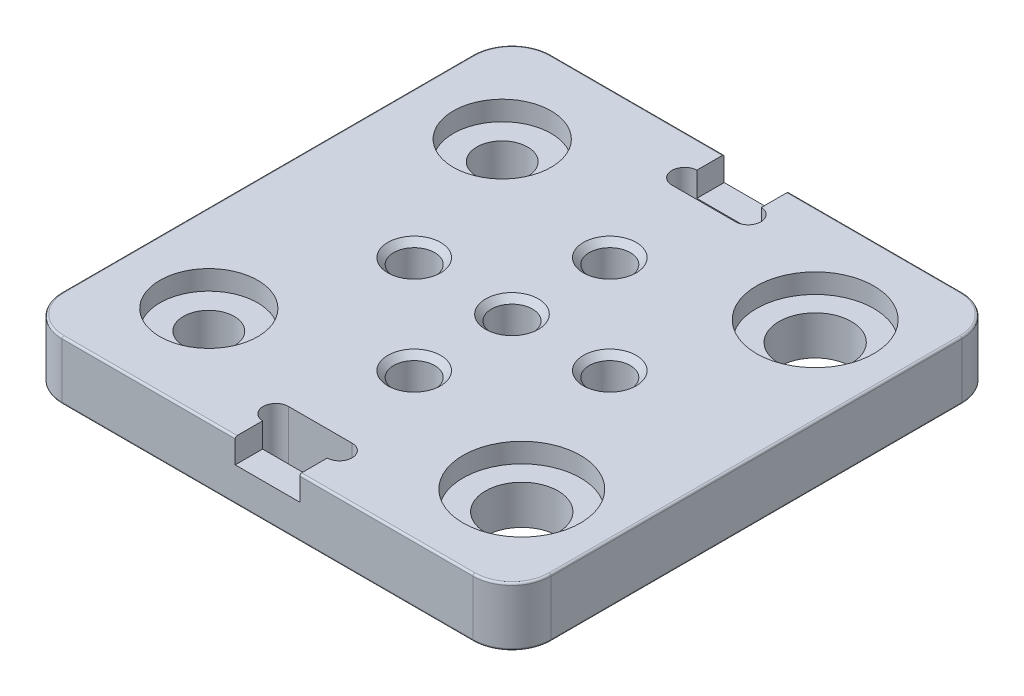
ISO-10303-21;
HEADER;
FILE_DESCRIPTION(('STEP AP214'),'2;1');
FILE_NAME('part.step','',(''),(''),'','','');
FILE_SCHEMA(('AUTOMOTIVE_DESIGN { 1 0 10303 214 1 1 1 1 }'));
ENDSEC;
DATA;
#1=APPLICATION_CONTEXT('core data for automotive mechanical design processes');
#2=APPLICATION_PROTOCOL_DEFINITION('international standard','automotive_design',2000,#1);
#3=PRODUCT_CONTEXT('',#1,'mechanical');
#4=PRODUCT('Part','Part','',(#3));
#5=PRODUCT_RELATED_PRODUCT_CATEGORY('part','',(#4));
#6=PRODUCT_DEFINITION_FORMATION('','',#4);
#7=PRODUCT_DEFINITION_CONTEXT('part definition',#1,'design');
#8=PRODUCT_DEFINITION('design','',#6,#7);
#9=PRODUCT_DEFINITION_SHAPE('','',#8);
#10=(LENGTH_UNIT() NAMED_UNIT(*) SI_UNIT(.MILLI.,.METRE.));
#11=(NAMED_UNIT(*) PLANE_ANGLE_UNIT() SI_UNIT($,.RADIAN.));
#12=(NAMED_UNIT(*) SI_UNIT($,.STERADIAN.) SOLID_ANGLE_UNIT());
#13=UNCERTAINTY_MEASURE_WITH_UNIT(LENGTH_MEASURE(1.E-05),#10,'distance_accuracy_value','');
#14=(GEOMETRIC_REPRESENTATION_CONTEXT(3) GLOBAL_UNCERTAINTY_ASSIGNED_CONTEXT((#13)) GLOBAL_UNIT_ASSIGNED_CONTEXT((#10,
#11,#12)) REPRESENTATION_CONTEXT('',''));
#15=CARTESIAN_POINT('',(0.,0.,0.));
#16=DIRECTION('',(0.,0.,1.));
#17=DIRECTION('',(1.,0.,0.));
#18=AXIS2_PLACEMENT_3D('',#15,#16,#17);
#19=CARTESIAN_POINT('',(-16.,6.,15.));
#20=DIRECTION('',(0.,-1.,0.));
#21=DIRECTION('',(0.,0.,-1.));
#22=AXIS2_PLACEMENT_3D('',#19,#20,#21);
#23=CYLINDRICAL_SURFACE('',#22,2.6);
#24=CARTESIAN_POINT('',(-16.,0.,15.));
#25=DIRECTION('',(0.,1.,0.));
#26=DIRECTION('',(0.,0.,1.));
#27=AXIS2_PLACEMENT_3D('',#24,#25,#26);
#28=CIRCLE('',#27,2.6);
#29=CARTESIAN_POINT('',(-16.,0.,17.6));
#30=VERTEX_POINT('',#29);
#31=EDGE_CURVE('E378',#30,#30,#28,.T.);
#32=ORIENTED_EDGE('',*,*,#31,.F.);
#33=EDGE_LOOP('',(#32));
#34=FACE_BOUND('',#33,.T.);
#35=CARTESIAN_POINT('',(-16.,4.,15.));
#36=DIRECTION('',(0.,1.,0.));
#37=DIRECTION('',(0.,0.,1.));
#38=AXIS2_PLACEMENT_3D('',#35,#36,#37);
#39=CIRCLE('',#38,2.6);
#40=CARTESIAN_POINT('',(-16.,4.,17.6));
#41=VERTEX_POINT('',#40);
#42=EDGE_CURVE('E20',#41,#41,#39,.T.);
#43=ORIENTED_EDGE('',*,*,#42,.T.);
#44=EDGE_LOOP('',(#43));
#45=FACE_BOUND('',#44,.T.);
#46=ADVANCED_FACE('F16',(#34,#45),#23,.F.);
#47=CARTESIAN_POINT('',(-16.,6.,-15.));
#48=DIRECTION('',(0.,-1.,0.));
#49=DIRECTION('',(0.,0.,-1.));
#50=AXIS2_PLACEMENT_3D('',#47,#48,#49);
#51=CYLINDRICAL_SURFACE('',#50,2.6);
#52=CARTESIAN_POINT('',(-16.,0.,-15.));
#53=DIRECTION('',(0.,1.,0.));
#54=DIRECTION('',(0.,0.,-1.));
#55=AXIS2_PLACEMENT_3D('',#52,#53,#54);
#56=CIRCLE('',#55,2.6);
#57=CARTESIAN_POINT('',(-16.,0.,-17.6));
#58=VERTEX_POINT('',#57);
#59=EDGE_CURVE('E375',#58,#58,#56,.T.);
#60=ORIENTED_EDGE('',*,*,#59,.F.);
#61=EDGE_LOOP('',(#60));
#62=FACE_BOUND('',#61,.T.);
#63=CARTESIAN_POINT('',(-16.,4.,-15.));
#64=DIRECTION('',(0.,1.,0.));
#65=DIRECTION('',(0.,0.,1.));
#66=AXIS2_PLACEMENT_3D('',#63,#64,#65);
#67=CIRCLE('',#66,2.6);
#68=CARTESIAN_POINT('',(-16.,4.,-12.4));
#69=VERTEX_POINT('',#68);
#70=EDGE_CURVE('E537',#69,#69,#67,.T.);
#71=ORIENTED_EDGE('',*,*,#70,.T.);
#72=EDGE_LOOP('',(#71));
#73=FACE_BOUND('',#72,.T.);
#74=ADVANCED_FACE('F749',(#62,#73),#51,.F.);
#75=CARTESIAN_POINT('',(16.,6.,-15.));
#76=DIRECTION('',(0.,-1.,0.));
#77=DIRECTION('',(0.,0.,-1.));
#78=AXIS2_PLACEMENT_3D('',#75,#76,#77);
#79=CYLINDRICAL_SURFACE('',#78,3.7);
#80=CARTESIAN_POINT('',(16.,0.,-15.));
#81=DIRECTION('',(0.,1.,0.));
#82=DIRECTION('',(0.,0.,1.));
#83=AXIS2_PLACEMENT_3D('',#80,#81,#82);
#84=CIRCLE('',#83,3.7);
#85=CARTESIAN_POINT('',(16.,0.,-11.3));
#86=VERTEX_POINT('',#85);
#87=EDGE_CURVE('E372',#86,#86,#84,.T.);
#88=ORIENTED_EDGE('',*,*,#87,.F.);
#89=EDGE_LOOP('',(#88));
#90=FACE_BOUND('',#89,.T.);
#91=CARTESIAN_POINT('',(16.,4.,-15.));
#92=DIRECTION('',(0.,1.,0.));
#93=DIRECTION('',(0.,0.,1.));
#94=AXIS2_PLACEMENT_3D('',#91,#92,#93);
#95=CIRCLE('',#94,3.7);
#96=CARTESIAN_POINT('',(16.,4.,-11.3));
#97=VERTEX_POINT('',#96);
#98=EDGE_CURVE('E534',#97,#97,#95,.T.);
#99=ORIENTED_EDGE('',*,*,#98,.T.);
#100=EDGE_LOOP('',(#99));
#101=FACE_BOUND('',#100,.T.);
#102=ADVANCED_FACE('F755',(#90,#101),#79,.F.);
#103=CARTESIAN_POINT('',(16.,6.,15.));
#104=DIRECTION('',(0.,-1.,0.));
#105=DIRECTION('',(0.,0.,-1.));
#106=AXIS2_PLACEMENT_3D('',#103,#104,#105);
#107=CYLINDRICAL_SURFACE('',#106,3.7);
#108=CARTESIAN_POINT('',(16.,0.,15.));
#109=DIRECTION('',(0.,1.,0.));
#110=DIRECTION('',(0.,0.,-1.));
#111=AXIS2_PLACEMENT_3D('',#108,#109,#110);
#112=CIRCLE('',#111,3.7);
#113=CARTESIAN_POINT('',(16.,0.,11.3));
#114=VERTEX_POINT('',#113);
#115=EDGE_CURVE('E369',#114,#114,#112,.T.);
#116=ORIENTED_EDGE('',*,*,#115,.F.);
#117=EDGE_LOOP('',(#116));
#118=FACE_BOUND('',#117,.T.);
#119=CARTESIAN_POINT('',(16.,4.,15.));
#120=DIRECTION('',(0.,1.,0.));
#121=DIRECTION('',(0.,0.,1.));
#122=AXIS2_PLACEMENT_3D('',#119,#120,#121);
#123=CIRCLE('',#122,3.7);
#124=CARTESIAN_POINT('',(16.,4.,18.7));
#125=VERTEX_POINT('',#124);
#126=EDGE_CURVE('E531',#125,#125,#123,.T.);
#127=ORIENTED_EDGE('',*,*,#126,.T.);
#128=EDGE_LOOP('',(#127));
#129=FACE_BOUND('',#128,.T.);
#130=ADVANCED_FACE('F780',(#118,#129),#107,.F.);
#131=CARTESIAN_POINT('',(3.25,6.,22.2));
#132=DIRECTION('',(0.,0.,-1.));
#133=DIRECTION('',(-1.,0.,0.));
#134=AXIS2_PLACEMENT_3D('',#131,#132,#133);
#135=PLANE('',#134);
#136=DIRECTION('',(0.,-1.,0.));
#137=VECTOR('',#136,1.);
#138=CARTESIAN_POINT('',(-3.25,6.,22.2));
#139=LINE('',#138,#137);
#140=CARTESIAN_POINT('',(-3.25,3.5,22.2));
#141=VERTEX_POINT('',#140);
#142=CARTESIAN_POINT('',(-3.25,0.,22.2));
#143=VERTEX_POINT('',#142);
#144=EDGE_CURVE('E362',#141,#143,#139,.T.);
#145=ORIENTED_EDGE('',*,*,#144,.F.);
#146=DIRECTION('',(1.,0.,0.));
#147=VECTOR('',#146,1.);
#148=CARTESIAN_POINT('',(3.25,3.5,22.2));
#149=LINE('',#148,#147);
#150=CARTESIAN_POINT('',(3.25,3.5,22.2));
#151=VERTEX_POINT('',#150);
#152=EDGE_CURVE('E406',#141,#151,#149,.T.);
#153=ORIENTED_EDGE('',*,*,#152,.T.);
#154=DIRECTION('',(0.,-1.,0.));
#155=VECTOR('',#154,1.);
#156=CARTESIAN_POINT('',(3.25,6.,22.2));
#157=LINE('',#156,#155);
#158=CARTESIAN_POINT('',(3.25,0.,22.2));
#159=VERTEX_POINT('',#158);
#160=EDGE_CURVE('E350',#151,#159,#157,.T.);
#161=ORIENTED_EDGE('',*,*,#160,.T.);
#162=DIRECTION('',(1.,0.,0.));
#163=VECTOR('',#162,1.);
#164=CARTESIAN_POINT('',(3.25,0.,22.2));
#165=LINE('',#164,#163);
#166=EDGE_CURVE('E345',#143,#159,#165,.T.);
#167=ORIENTED_EDGE('',*,*,#166,.F.);
#168=EDGE_LOOP('',(#145,#153,#161,#167));
#169=FACE_BOUND('',#168,.T.);
#170=ADVANCED_FACE('F782',(#169),#135,.T.);
#171=CARTESIAN_POINT('',(3.25000000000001,6.,-22.2));
#172=DIRECTION('',(0.,0.,1.));
#173=DIRECTION('',(1.,0.,0.));
#174=AXIS2_PLACEMENT_3D('',#171,#172,#173);
#175=PLANE('',#174);
#176=DIRECTION('',(0.,-1.,0.));
#177=VECTOR('',#176,1.);
#178=CARTESIAN_POINT('',(3.25000000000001,6.,-22.2));
#179=LINE('',#178,#177);
#180=CARTESIAN_POINT('',(3.25000000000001,3.5,-22.2));
#181=VERTEX_POINT('',#180);
#182=CARTESIAN_POINT('',(3.25000000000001,0.,-22.2));
#183=VERTEX_POINT('',#182);
#184=EDGE_CURVE('E339',#181,#183,#179,.T.);
#185=ORIENTED_EDGE('',*,*,#184,.F.);
#186=DIRECTION('',(-1.,0.,0.));
#187=VECTOR('',#186,1.);
#188=CARTESIAN_POINT('',(3.25000000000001,3.5,-22.2));
#189=LINE('',#188,#187);
#190=CARTESIAN_POINT('',(-3.25000000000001,3.5,-22.2));
#191=VERTEX_POINT('',#190);
#192=EDGE_CURVE('E276',#181,#191,#189,.T.);
#193=ORIENTED_EDGE('',*,*,#192,.T.);
#194=DIRECTION('',(0.,-1.,0.));
#195=VECTOR('',#194,1.);
#196=CARTESIAN_POINT('',(-3.25000000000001,6.,-22.2));
#197=LINE('',#196,#195);
#198=CARTESIAN_POINT('',(-3.25000000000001,0.,-22.2));
#199=VERTEX_POINT('',#198);
#200=EDGE_CURVE('E337',#191,#199,#197,.T.);
#201=ORIENTED_EDGE('',*,*,#200,.T.);
#202=DIRECTION('',(-1.,0.,0.));
#203=VECTOR('',#202,1.);
#204=CARTESIAN_POINT('',(3.25000000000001,0.,-22.2));
#205=LINE('',#204,#203);
#206=EDGE_CURVE('E325',#183,#199,#205,.T.);
#207=ORIENTED_EDGE('',*,*,#206,.F.);
#208=EDGE_LOOP('',(#185,#193,#201,#207));
#209=FACE_BOUND('',#208,.T.);
#210=ADVANCED_FACE('F593',(#209),#175,.T.);
#211=CARTESIAN_POINT('',(21.,6.,21.));
#212=DIRECTION('',(0.,1.,0.));
#213=DIRECTION('',(0.,0.,1.));
#214=AXIS2_PLACEMENT_3D('',#211,#212,#213);
#215=PLANE('',#214);
#216=CARTESIAN_POINT('',(0.,6.,0.));
#217=DIRECTION('',(0.,1.,0.));
#218=DIRECTION('',(0.,0.,1.));
#219=AXIS2_PLACEMENT_3D('',#216,#217,#218);
#220=CIRCLE('',#219,2.7);
#221=CARTESIAN_POINT('',(0.,6.,2.7));
#222=VERTEX_POINT('',#221);
#223=EDGE_CURVE('E1391',#222,#222,#220,.T.);
#224=ORIENTED_EDGE('',*,*,#223,.F.);
#225=EDGE_LOOP('',(#224));
#226=FACE_BOUND('',#225,.T.);
#227=CARTESIAN_POINT('',(-10.,6.,0.));
#228=DIRECTION('',(0.,1.,0.));
#229=DIRECTION('',(0.,0.,1.));
#230=AXIS2_PLACEMENT_3D('',#227,#228,#229);
#231=CIRCLE('',#230,2.7);
#232=CARTESIAN_POINT('',(-10.,6.,2.7));
#233=VERTEX_POINT('',#232);
#234=EDGE_CURVE('E1404',#233,#233,#231,.T.);
#235=ORIENTED_EDGE('',*,*,#234,.F.);
#236=EDGE_LOOP('',(#235));
#237=FACE_BOUND('',#236,.T.);
#238=CARTESIAN_POINT('',(0.,6.,-10.));
#239=DIRECTION('',(0.,1.,0.));
#240=DIRECTION('',(0.,0.,1.));
#241=AXIS2_PLACEMENT_3D('',#238,#239,#240);
#242=CIRCLE('',#241,2.7);
#243=CARTESIAN_POINT('',(0.,6.,-7.3));
#244=VERTEX_POINT('',#243);
#245=EDGE_CURVE('E1416',#244,#244,#242,.T.);
#246=ORIENTED_EDGE('',*,*,#245,.F.);
#247=EDGE_LOOP('',(#246));
#248=FACE_BOUND('',#247,.T.);
#249=CARTESIAN_POINT('',(10.,6.,0.));
#250=DIRECTION('',(0.,1.,0.));
#251=DIRECTION('',(0.,0.,1.));
#252=AXIS2_PLACEMENT_3D('',#249,#250,#251);
#253=CIRCLE('',#252,2.7);
#254=CARTESIAN_POINT('',(10.,6.,2.7));
#255=VERTEX_POINT('',#254);
#256=EDGE_CURVE('E1428',#255,#255,#253,.T.);
#257=ORIENTED_EDGE('',*,*,#256,.F.);
#258=EDGE_LOOP('',(#257));
#259=FACE_BOUND('',#258,.T.);
#260=CARTESIAN_POINT('',(0.,6.,10.));
#261=DIRECTION('',(0.,1.,0.));
#262=DIRECTION('',(0.,0.,1.));
#263=AXIS2_PLACEMENT_3D('',#260,#261,#262);
#264=CIRCLE('',#263,2.7);
#265=CARTESIAN_POINT('',(0.,6.,12.7));
#266=VERTEX_POINT('',#265);
#267=EDGE_CURVE('E1440',#266,#266,#264,.T.);
#268=ORIENTED_EDGE('',*,*,#267,.F.);
#269=EDGE_LOOP('',(#268));
#270=FACE_BOUND('',#269,.T.);
#271=CARTESIAN_POINT('',(16.,6.,-15.));
#272=DIRECTION('',(0.,1.,0.));
#273=DIRECTION('',(0.,0.,1.));
#274=AXIS2_PLACEMENT_3D('',#271,#272,#273);
#275=CIRCLE('',#274,6.);
#276=CARTESIAN_POINT('',(16.,6.,-9.));
#277=VERTEX_POINT('',#276);
#278=EDGE_CURVE('E574',#277,#277,#275,.T.);
#279=ORIENTED_EDGE('',*,*,#278,.F.);
#280=EDGE_LOOP('',(#279));
#281=FACE_BOUND('',#280,.T.);
#282=CARTESIAN_POINT('',(16.,6.,15.));
#283=DIRECTION('',(0.,1.,0.));
#284=DIRECTION('',(0.,0.,1.));
#285=AXIS2_PLACEMENT_3D('',#282,#283,#284);
#286=CIRCLE('',#285,6.);
#287=CARTESIAN_POINT('',(16.,6.,21.));
#288=VERTEX_POINT('',#287);
#289=EDGE_CURVE('E568',#288,#288,#286,.T.);
#290=ORIENTED_EDGE('',*,*,#289,.F.);
#291=EDGE_LOOP('',(#290));
#292=FACE_BOUND('',#291,.T.);
#293=CARTESIAN_POINT('',(-16.,6.,15.));
#294=DIRECTION('',(0.,1.,0.));
#295=DIRECTION('',(0.,0.,1.));
#296=AXIS2_PLACEMENT_3D('',#293,#294,#295);
#297=CIRCLE('',#296,5.);
#298=CARTESIAN_POINT('',(-16.,6.,20.));
#299=VERTEX_POINT('',#298);
#300=EDGE_CURVE('E556',#299,#299,#297,.T.);
#301=ORIENTED_EDGE('',*,*,#300,.F.);
#302=EDGE_LOOP('',(#301));
#303=FACE_BOUND('',#302,.T.);
#304=CARTESIAN_POINT('',(-16.,6.,-15.));
#305=DIRECTION('',(0.,1.,0.));
#306=DIRECTION('',(0.,0.,1.));
#307=AXIS2_PLACEMENT_3D('',#304,#305,#306);
#308=CIRCLE('',#307,5.);
#309=CARTESIAN_POINT('',(-16.,6.,-10.));
#310=VERTEX_POINT('',#309);
#311=EDGE_CURVE('E555',#310,#310,#308,.T.);
#312=ORIENTED_EDGE('',*,*,#311,.F.);
#313=EDGE_LOOP('',(#312));
#314=FACE_BOUND('',#313,.T.);
#315=DIRECTION('',(0.,0.,-1.));
#316=VECTOR('',#315,1.);
#317=CARTESIAN_POINT('',(3.3,6.,22.1990381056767));
#318=LINE('',#317,#316);
#319=CARTESIAN_POINT('',(3.3,6.,24.8));
#320=VERTEX_POINT('',#319);
#321=CARTESIAN_POINT('',(3.3,6.,22.1990381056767));
#322=VERTEX_POINT('',#321);
#323=EDGE_CURVE('E261',#320,#322,#318,.T.);
#324=ORIENTED_EDGE('',*,*,#323,.F.);
#325=DIRECTION('',(1.,0.,0.));
#326=VECTOR('',#325,1.);
#327=CARTESIAN_POINT('',(21.,6.,24.8));
#328=LINE('',#327,#326);
#329=CARTESIAN_POINT('',(21.,6.,24.8));
#330=VERTEX_POINT('',#329);
#331=EDGE_CURVE('E428',#320,#330,#328,.T.);
#332=ORIENTED_EDGE('',*,*,#331,.T.);
#333=CARTESIAN_POINT('',(21.,6.,21.));
#334=DIRECTION('',(0.,1.,0.));
#335=DIRECTION('',(0.,0.,1.));
#336=AXIS2_PLACEMENT_3D('',#333,#334,#335);
#337=CIRCLE('',#336,3.8);
#338=CARTESIAN_POINT('',(24.8,6.,21.));
#339=VERTEX_POINT('',#338);
#340=EDGE_CURVE('E426',#330,#339,#337,.T.);
#341=ORIENTED_EDGE('',*,*,#340,.T.);
#342=DIRECTION('',(0.,0.,-1.));
#343=VECTOR('',#342,1.);
#344=CARTESIAN_POINT('',(24.8,6.,-21.));
#345=LINE('',#344,#343);
#346=CARTESIAN_POINT('',(24.8,6.,-21.));
#347=VERTEX_POINT('',#346);
#348=EDGE_CURVE('E420',#339,#347,#345,.T.);
#349=ORIENTED_EDGE('',*,*,#348,.T.);
#350=CARTESIAN_POINT('',(21.,6.,-21.));
#351=DIRECTION('',(0.,1.,0.));
#352=DIRECTION('',(0.,0.,1.));
#353=AXIS2_PLACEMENT_3D('',#350,#351,#352);
#354=CIRCLE('',#353,3.8);
#355=CARTESIAN_POINT('',(21.,6.,-24.8));
#356=VERTEX_POINT('',#355);
#357=EDGE_CURVE('E422',#347,#356,#354,.T.);
#358=ORIENTED_EDGE('',*,*,#357,.T.);
#359=DIRECTION('',(-1.,0.,0.));
#360=VECTOR('',#359,1.);
#361=CARTESIAN_POINT('',(3.29999999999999,6.,-24.8));
#362=LINE('',#361,#360);
#363=CARTESIAN_POINT('',(3.29999999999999,6.,-24.8));
#364=VERTEX_POINT('',#363);
#365=EDGE_CURVE('E424',#356,#364,#362,.T.);
#366=ORIENTED_EDGE('',*,*,#365,.T.);
#367=DIRECTION('',(0.,0.,-1.));
#368=VECTOR('',#367,1.);
#369=CARTESIAN_POINT('',(3.29999999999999,6.,-22.1990381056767));
#370=LINE('',#369,#368);
#371=CARTESIAN_POINT('',(3.29999999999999,6.,-22.1990381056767));
#372=VERTEX_POINT('',#371);
#373=EDGE_CURVE('E290',#372,#364,#370,.T.);
#374=ORIENTED_EDGE('',*,*,#373,.F.);
#375=CARTESIAN_POINT('',(3.25,6.,-20.9));
#376=DIRECTION('',(0.,1.,0.));
#377=DIRECTION('',(0.,0.,-1.));
#378=AXIS2_PLACEMENT_3D('',#375,#376,#377);
#379=CIRCLE('',#378,1.3);
#380=CARTESIAN_POINT('',(3.25000000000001,6.,-19.6));
#381=VERTEX_POINT('',#380);
#382=EDGE_CURVE('E314',#381,#372,#379,.T.);
#383=ORIENTED_EDGE('',*,*,#382,.F.);
#384=DIRECTION('',(1.,0.,0.));
#385=VECTOR('',#384,1.);
#386=CARTESIAN_POINT('',(3.25000000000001,6.,-19.6));
#387=LINE('',#386,#385);
#388=CARTESIAN_POINT('',(-3.25000000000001,6.,-19.6));
#389=VERTEX_POINT('',#388);
#390=EDGE_CURVE('E320',#389,#381,#387,.T.);
#391=ORIENTED_EDGE('',*,*,#390,.F.);
#392=CARTESIAN_POINT('',(-3.25,6.,-20.9));
#393=DIRECTION('',(0.,1.,0.));
#394=DIRECTION('',(0.,0.,-1.));
#395=AXIS2_PLACEMENT_3D('',#392,#393,#394);
#396=CIRCLE('',#395,1.3);
#397=CARTESIAN_POINT('',(-3.3,6.,-22.1990381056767));
#398=VERTEX_POINT('',#397);
#399=EDGE_CURVE('E317',#398,#389,#396,.T.);
#400=ORIENTED_EDGE('',*,*,#399,.F.);
#401=DIRECTION('',(0.,0.,1.));
#402=VECTOR('',#401,1.);
#403=CARTESIAN_POINT('',(-3.3,6.,-22.1990381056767));
#404=LINE('',#403,#402);
#405=CARTESIAN_POINT('',(-3.30000000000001,6.,-24.8));
#406=VERTEX_POINT('',#405);
#407=EDGE_CURVE('E285',#406,#398,#404,.T.);
#408=ORIENTED_EDGE('',*,*,#407,.F.);
#409=DIRECTION('',(-1.,0.,0.));
#410=VECTOR('',#409,1.);
#411=CARTESIAN_POINT('',(-21.,6.,-24.8));
#412=LINE('',#411,#410);
#413=CARTESIAN_POINT('',(-21.,6.,-24.8));
#414=VERTEX_POINT('',#413);
#415=EDGE_CURVE('E417',#406,#414,#412,.T.);
#416=ORIENTED_EDGE('',*,*,#415,.T.);
#417=CARTESIAN_POINT('',(-21.,6.,-21.));
#418=DIRECTION('',(0.,1.,0.));
#419=DIRECTION('',(0.,0.,1.));
#420=AXIS2_PLACEMENT_3D('',#417,#418,#419);
#421=CIRCLE('',#420,3.8);
#422=CARTESIAN_POINT('',(-24.8,6.,-21.));
#423=VERTEX_POINT('',#422);
#424=EDGE_CURVE('E415',#414,#423,#421,.T.);
#425=ORIENTED_EDGE('',*,*,#424,.T.);
#426=DIRECTION('',(0.,0.,1.));
#427=VECTOR('',#426,1.);
#428=CARTESIAN_POINT('',(-24.8,6.,21.));
#429=LINE('',#428,#427);
#430=CARTESIAN_POINT('',(-24.8,6.,21.));
#431=VERTEX_POINT('',#430);
#432=EDGE_CURVE('E409',#423,#431,#429,.T.);
#433=ORIENTED_EDGE('',*,*,#432,.T.);
#434=CARTESIAN_POINT('',(-21.,6.,21.));
#435=DIRECTION('',(0.,1.,0.));
#436=DIRECTION('',(0.,0.,1.));
#437=AXIS2_PLACEMENT_3D('',#434,#435,#436);
#438=CIRCLE('',#437,3.8);
#439=CARTESIAN_POINT('',(-21.,6.,24.8));
#440=VERTEX_POINT('',#439);
#441=EDGE_CURVE('E411',#431,#440,#438,.T.);
#442=ORIENTED_EDGE('',*,*,#441,.T.);
#443=DIRECTION('',(1.,0.,0.));
#444=VECTOR('',#443,1.);
#445=CARTESIAN_POINT('',(-3.3,6.,24.8));
#446=LINE('',#445,#444);
#447=CARTESIAN_POINT('',(-3.3,6.,24.8));
#448=VERTEX_POINT('',#447);
#449=EDGE_CURVE('E413',#440,#448,#446,.T.);
#450=ORIENTED_EDGE('',*,*,#449,.T.);
#451=DIRECTION('',(0.,0.,1.));
#452=VECTOR('',#451,1.);
#453=CARTESIAN_POINT('',(-3.3,6.,22.1990381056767));
#454=LINE('',#453,#452);
#455=CARTESIAN_POINT('',(-3.3,6.,22.1990381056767));
#456=VERTEX_POINT('',#455);
#457=EDGE_CURVE('E270',#456,#448,#454,.T.);
#458=ORIENTED_EDGE('',*,*,#457,.F.);
#459=CARTESIAN_POINT('',(-3.25,6.,20.9));
#460=DIRECTION('',(0.,1.,0.));
#461=DIRECTION('',(0.,0.,1.));
#462=AXIS2_PLACEMENT_3D('',#459,#460,#461);
#463=CIRCLE('',#462,1.3);
#464=CARTESIAN_POINT('',(-3.25,6.,19.6));
#465=VERTEX_POINT('',#464);
#466=EDGE_CURVE('E347',#465,#456,#463,.T.);
#467=ORIENTED_EDGE('',*,*,#466,.F.);
#468=DIRECTION('',(-1.,0.,0.));
#469=VECTOR('',#468,1.);
#470=CARTESIAN_POINT('',(3.25,6.,19.6));
#471=LINE('',#470,#469);
#472=CARTESIAN_POINT('',(3.25,6.,19.6));
#473=VERTEX_POINT('',#472);
#474=EDGE_CURVE('E344',#473,#465,#471,.T.);
#475=ORIENTED_EDGE('',*,*,#474,.F.);
#476=CARTESIAN_POINT('',(3.25,6.,20.9));
#477=DIRECTION('',(0.,1.,0.));
#478=DIRECTION('',(0.,0.,1.));
#479=AXIS2_PLACEMENT_3D('',#476,#477,#478);
#480=CIRCLE('',#479,1.3);
#481=EDGE_CURVE('E342',#322,#473,#480,.T.);
#482=ORIENTED_EDGE('',*,*,#481,.F.);
#483=EDGE_LOOP('',(#324,#332,#341,#349,#358,#366,#374,#383,#391,#400,#408,#416,#425,#433,#442,
#450,#458,#467,#475,#482));
#484=FACE_BOUND('',#483,.T.);
#485=ADVANCED_FACE('F589',(#226,#237,#248,#259,#270,#281,#292,#303,#314,#484),#215,.T.);
#486=CARTESIAN_POINT('',(21.,0.,21.));
#487=DIRECTION('',(0.,1.,0.));
#488=DIRECTION('',(0.,0.,1.));
#489=AXIS2_PLACEMENT_3D('',#486,#487,#488);
#490=PLANE('',#489);
#491=CARTESIAN_POINT('',(0.,0.,0.));
#492=DIRECTION('',(0.,1.,0.));
#493=DIRECTION('',(0.,0.,1.));
#494=AXIS2_PLACEMENT_3D('',#491,#492,#493);
#495=CIRCLE('',#494,2.7);
#496=CARTESIAN_POINT('',(0.,0.,2.7));
#497=VERTEX_POINT('',#496);
#498=EDGE_CURVE('E1392',#497,#497,#495,.T.);
#499=ORIENTED_EDGE('',*,*,#498,.T.);
#500=EDGE_LOOP('',(#499));
#501=FACE_BOUND('',#500,.T.);
#502=CARTESIAN_POINT('',(-10.,0.,0.));
#503=DIRECTION('',(0.,1.,0.));
#504=DIRECTION('',(0.,0.,1.));
#505=AXIS2_PLACEMENT_3D('',#502,#503,#504);
#506=CIRCLE('',#505,2.7);
#507=CARTESIAN_POINT('',(-10.,0.,2.7));
#508=VERTEX_POINT('',#507);
#509=EDGE_CURVE('E1401',#508,#508,#506,.T.);
#510=ORIENTED_EDGE('',*,*,#509,.T.);
#511=EDGE_LOOP('',(#510));
#512=FACE_BOUND('',#511,.T.);
#513=CARTESIAN_POINT('',(0.,0.,-10.));
#514=DIRECTION('',(0.,1.,0.));
#515=DIRECTION('',(0.,0.,1.));
#516=AXIS2_PLACEMENT_3D('',#513,#514,#515);
#517=CIRCLE('',#516,2.7);
#518=CARTESIAN_POINT('',(0.,0.,-7.3));
#519=VERTEX_POINT('',#518);
#520=EDGE_CURVE('E1413',#519,#519,#517,.T.);
#521=ORIENTED_EDGE('',*,*,#520,.T.);
#522=EDGE_LOOP('',(#521));
#523=FACE_BOUND('',#522,.T.);
#524=CARTESIAN_POINT('',(10.,0.,0.));
#525=DIRECTION('',(0.,1.,0.));
#526=DIRECTION('',(0.,0.,1.));
#527=AXIS2_PLACEMENT_3D('',#524,#525,#526);
#528=CIRCLE('',#527,2.7);
#529=CARTESIAN_POINT('',(10.,0.,2.7));
#530=VERTEX_POINT('',#529);
#531=EDGE_CURVE('E1425',#530,#530,#528,.T.);
#532=ORIENTED_EDGE('',*,*,#531,.T.);
#533=EDGE_LOOP('',(#532));
#534=FACE_BOUND('',#533,.T.);
#535=CARTESIAN_POINT('',(0.,0.,10.));
#536=DIRECTION('',(0.,1.,0.));
#537=DIRECTION('',(0.,0.,1.));
#538=AXIS2_PLACEMENT_3D('',#535,#536,#537);
#539=CIRCLE('',#538,2.7);
#540=CARTESIAN_POINT('',(0.,0.,12.7));
#541=VERTEX_POINT('',#540);
#542=EDGE_CURVE('E1437',#541,#541,#539,.T.);
#543=ORIENTED_EDGE('',*,*,#542,.T.);
#544=EDGE_LOOP('',(#543));
#545=FACE_BOUND('',#544,.T.);
#546=DIRECTION('',(0.,0.,1.));
#547=VECTOR('',#546,1.);
#548=CARTESIAN_POINT('',(-24.8,0.,21.));
#549=LINE('',#548,#547);
#550=CARTESIAN_POINT('',(-24.8,0.,21.));
#551=VERTEX_POINT('',#550);
#552=CARTESIAN_POINT('',(-24.8,0.,-21.));
#553=VERTEX_POINT('',#552);
#554=EDGE_CURVE('E460',#551,#553,#549,.F.);
#555=ORIENTED_EDGE('',*,*,#554,.T.);
#556=CARTESIAN_POINT('',(-21.,0.,-21.));
#557=DIRECTION('',(0.,1.,0.));
#558=DIRECTION('',(0.,0.,1.));
#559=AXIS2_PLACEMENT_3D('',#556,#557,#558);
#560=CIRCLE('',#559,3.8);
#561=CARTESIAN_POINT('',(-21.,0.,-24.8));
#562=VERTEX_POINT('',#561);
#563=EDGE_CURVE('E474',#553,#562,#560,.F.);
#564=ORIENTED_EDGE('',*,*,#563,.T.);
#565=DIRECTION('',(-1.,0.,0.));
#566=VECTOR('',#565,1.);
#567=CARTESIAN_POINT('',(21.,0.,-24.8));
#568=LINE('',#567,#566);
#569=CARTESIAN_POINT('',(21.,0.,-24.8));
#570=VERTEX_POINT('',#569);
#571=EDGE_CURVE('E472',#562,#570,#568,.F.);
#572=ORIENTED_EDGE('',*,*,#571,.T.);
#573=CARTESIAN_POINT('',(21.,0.,-21.));
#574=DIRECTION('',(0.,1.,0.));
#575=DIRECTION('',(0.,0.,1.));
#576=AXIS2_PLACEMENT_3D('',#573,#574,#575);
#577=CIRCLE('',#576,3.8);
#578=CARTESIAN_POINT('',(24.8,0.,-21.));
#579=VERTEX_POINT('',#578);
#580=EDGE_CURVE('E470',#570,#579,#577,.F.);
#581=ORIENTED_EDGE('',*,*,#580,.T.);
#582=DIRECTION('',(0.,0.,-1.));
#583=VECTOR('',#582,1.);
#584=CARTESIAN_POINT('',(24.8,0.,21.));
#585=LINE('',#584,#583);
#586=CARTESIAN_POINT('',(24.8,0.,21.));
#587=VERTEX_POINT('',#586);
#588=EDGE_CURVE('E468',#579,#587,#585,.F.);
#589=ORIENTED_EDGE('',*,*,#588,.T.);
#590=CARTESIAN_POINT('',(21.,0.,21.));
#591=DIRECTION('',(0.,1.,0.));
#592=DIRECTION('',(0.,0.,1.));
#593=AXIS2_PLACEMENT_3D('',#590,#591,#592);
#594=CIRCLE('',#593,3.8);
#595=CARTESIAN_POINT('',(21.,0.,24.8));
#596=VERTEX_POINT('',#595);
#597=EDGE_CURVE('E466',#587,#596,#594,.F.);
#598=ORIENTED_EDGE('',*,*,#597,.T.);
#599=DIRECTION('',(1.,0.,0.));
#600=VECTOR('',#599,1.);
#601=CARTESIAN_POINT('',(21.,0.,24.8));
#602=LINE('',#601,#600);
#603=CARTESIAN_POINT('',(-21.,0.,24.8));
#604=VERTEX_POINT('',#603);
#605=EDGE_CURVE('E464',#596,#604,#602,.F.);
#606=ORIENTED_EDGE('',*,*,#605,.T.);
#607=CARTESIAN_POINT('',(-21.,0.,21.));
#608=DIRECTION('',(0.,1.,0.));
#609=DIRECTION('',(0.,0.,1.));
#610=AXIS2_PLACEMENT_3D('',#607,#608,#609);
#611=CIRCLE('',#610,3.8);
#612=EDGE_CURVE('E462',#604,#551,#611,.F.);
#613=ORIENTED_EDGE('',*,*,#612,.T.);
#614=EDGE_LOOP('',(#555,#564,#572,#581,#589,#598,#606,#613));
#615=FACE_BOUND('',#614,.T.);
#616=CARTESIAN_POINT('',(3.25,0.,20.9));
#617=DIRECTION('',(0.,1.,0.));
#618=DIRECTION('',(0.,0.,1.));
#619=AXIS2_PLACEMENT_3D('',#616,#617,#618);
#620=CIRCLE('',#619,1.3);
#621=CARTESIAN_POINT('',(3.25,0.,19.6));
#622=VERTEX_POINT('',#621);
#623=EDGE_CURVE('E341',#159,#622,#620,.T.);
#624=ORIENTED_EDGE('',*,*,#623,.T.);
#625=DIRECTION('',(-1.,0.,0.));
#626=VECTOR('',#625,1.);
#627=CARTESIAN_POINT('',(3.25,0.,19.6));
#628=LINE('',#627,#626);
#629=CARTESIAN_POINT('',(-3.25,0.,19.6));
#630=VERTEX_POINT('',#629);
#631=EDGE_CURVE('E353',#622,#630,#628,.T.);
#632=ORIENTED_EDGE('',*,*,#631,.T.);
#633=CARTESIAN_POINT('',(-3.25,0.,20.9));
#634=DIRECTION('',(0.,1.,0.));
#635=DIRECTION('',(0.,0.,1.));
#636=AXIS2_PLACEMENT_3D('',#633,#634,#635);
#637=CIRCLE('',#636,1.3);
#638=EDGE_CURVE('E356',#630,#143,#637,.T.);
#639=ORIENTED_EDGE('',*,*,#638,.T.);
#640=ORIENTED_EDGE('',*,*,#166,.T.);
#641=EDGE_LOOP('',(#624,#632,#639,#640));
#642=FACE_BOUND('',#641,.T.);
#643=ORIENTED_EDGE('',*,*,#31,.T.);
#644=EDGE_LOOP('',(#643));
#645=FACE_BOUND('',#644,.T.);
#646=ORIENTED_EDGE('',*,*,#59,.T.);
#647=EDGE_LOOP('',(#646));
#648=FACE_BOUND('',#647,.T.);
#649=ORIENTED_EDGE('',*,*,#87,.T.);
#650=EDGE_LOOP('',(#649));
#651=FACE_BOUND('',#650,.T.);
#652=ORIENTED_EDGE('',*,*,#115,.T.);
#653=EDGE_LOOP('',(#652));
#654=FACE_BOUND('',#653,.T.);
#655=CARTESIAN_POINT('',(3.25,0.,-20.9));
#656=DIRECTION('',(0.,1.,0.));
#657=DIRECTION('',(0.,0.,-1.));
#658=AXIS2_PLACEMENT_3D('',#655,#656,#657);
#659=CIRCLE('',#658,1.3);
#660=CARTESIAN_POINT('',(3.25000000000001,0.,-19.6));
#661=VERTEX_POINT('',#660);
#662=EDGE_CURVE('E313',#661,#183,#659,.T.);
#663=ORIENTED_EDGE('',*,*,#662,.T.);
#664=ORIENTED_EDGE('',*,*,#206,.T.);
#665=CARTESIAN_POINT('',(-3.25,0.,-20.9));
#666=DIRECTION('',(0.,1.,0.));
#667=DIRECTION('',(0.,0.,-1.));
#668=AXIS2_PLACEMENT_3D('',#665,#666,#667);
#669=CIRCLE('',#668,1.3);
#670=CARTESIAN_POINT('',(-3.25000000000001,0.,-19.6));
#671=VERTEX_POINT('',#670);
#672=EDGE_CURVE('E328',#199,#671,#669,.T.);
#673=ORIENTED_EDGE('',*,*,#672,.T.);
#674=DIRECTION('',(1.,0.,0.));
#675=VECTOR('',#674,1.);
#676=CARTESIAN_POINT('',(3.25000000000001,0.,-19.6));
#677=LINE('',#676,#675);
#678=EDGE_CURVE('E318',#671,#661,#677,.T.);
#679=ORIENTED_EDGE('',*,*,#678,.T.);
#680=EDGE_LOOP('',(#663,#664,#673,#679));
#681=FACE_BOUND('',#680,.T.);
#682=ADVANCED_FACE('F592',(#501,#512,#523,#534,#545,#615,#642,#645,#648,#651,#654,#681),#490,.F.);
#683=CARTESIAN_POINT('',(21.,6.,21.));
#684=DIRECTION('',(0.,-1.,0.));
#685=DIRECTION('',(0.,0.,-1.));
#686=AXIS2_PLACEMENT_3D('',#683,#684,#685);
#687=CYLINDRICAL_SURFACE('',#686,4.);
#688=DIRECTION('',(0.,-1.,0.));
#689=VECTOR('',#688,1.);
#690=CARTESIAN_POINT('',(25.,6.,21.));
#691=LINE('',#690,#689);
#692=CARTESIAN_POINT('',(25.,5.8,21.));
#693=VERTEX_POINT('',#692);
#694=CARTESIAN_POINT('',(25.,0.2,21.));
#695=VERTEX_POINT('',#694);
#696=EDGE_CURVE('E400',#693,#695,#691,.T.);
#697=ORIENTED_EDGE('',*,*,#696,.F.);
#698=CARTESIAN_POINT('',(21.,5.8,21.));
#699=DIRECTION('',(0.,1.,0.));
#700=DIRECTION('',(0.,0.,1.));
#701=AXIS2_PLACEMENT_3D('',#698,#699,#700);
#702=CIRCLE('',#701,4.);
#703=CARTESIAN_POINT('',(21.,5.8,25.));
#704=VERTEX_POINT('',#703);
#705=EDGE_CURVE('E441',#693,#704,#702,.F.);
#706=ORIENTED_EDGE('',*,*,#705,.T.);
#707=DIRECTION('',(0.,-1.,0.));
#708=VECTOR('',#707,1.);
#709=CARTESIAN_POINT('',(21.,6.,25.));
#710=LINE('',#709,#708);
#711=CARTESIAN_POINT('',(21.,0.2,25.));
#712=VERTEX_POINT('',#711);
#713=EDGE_CURVE('E381',#704,#712,#710,.T.);
#714=ORIENTED_EDGE('',*,*,#713,.T.);
#715=CARTESIAN_POINT('',(21.,0.2,21.));
#716=DIRECTION('',(0.,1.,0.));
#717=DIRECTION('',(0.,0.,1.));
#718=AXIS2_PLACEMENT_3D('',#715,#716,#717);
#719=CIRCLE('',#718,4.);
#720=EDGE_CURVE('E439',#712,#695,#719,.T.);
#721=ORIENTED_EDGE('',*,*,#720,.T.);
#722=EDGE_LOOP('',(#697,#706,#714,#721));
#723=FACE_BOUND('',#722,.T.);
#724=ADVANCED_FACE('F728',(#723),#687,.T.);
#725=CARTESIAN_POINT('',(25.,6.,-21.));
#726=DIRECTION('',(-1.,0.,0.));
#727=DIRECTION('',(0.,0.,1.));
#728=AXIS2_PLACEMENT_3D('',#725,#726,#727);
#729=PLANE('',#728);
#730=ORIENTED_EDGE('',*,*,#696,.T.);
#731=DIRECTION('',(0.,0.,-1.));
#732=VECTOR('',#731,1.);
#733=CARTESIAN_POINT('',(25.,0.2,-21.));
#734=LINE('',#733,#732);
#735=CARTESIAN_POINT('',(25.,0.2,-21.));
#736=VERTEX_POINT('',#735);
#737=EDGE_CURVE('E479',#695,#736,#734,.T.);
#738=ORIENTED_EDGE('',*,*,#737,.T.);
#739=DIRECTION('',(0.,-1.,0.));
#740=VECTOR('',#739,1.);
#741=CARTESIAN_POINT('',(25.,6.,-21.));
#742=LINE('',#741,#740);
#743=CARTESIAN_POINT('',(25.,5.8,-21.));
#744=VERTEX_POINT('',#743);
#745=EDGE_CURVE('E397',#744,#736,#742,.T.);
#746=ORIENTED_EDGE('',*,*,#745,.F.);
#747=DIRECTION('',(0.,0.,-1.));
#748=VECTOR('',#747,1.);
#749=CARTESIAN_POINT('',(25.,5.8,21.));
#750=LINE('',#749,#748);
#751=EDGE_CURVE('E477',#744,#693,#750,.F.);
#752=ORIENTED_EDGE('',*,*,#751,.T.);
#753=EDGE_LOOP('',(#730,#738,#746,#752));
#754=FACE_BOUND('',#753,.T.);
#755=ADVANCED_FACE('F730',(#754),#729,.F.);
#756=CARTESIAN_POINT('',(21.,6.,-21.));
#757=DIRECTION('',(0.,-1.,0.));
#758=DIRECTION('',(0.,0.,-1.));
#759=AXIS2_PLACEMENT_3D('',#756,#757,#758);
#760=CYLINDRICAL_SURFACE('',#759,4.);
#761=DIRECTION('',(0.,-1.,0.));
#762=VECTOR('',#761,1.);
#763=CARTESIAN_POINT('',(21.,6.,-25.));
#764=LINE('',#763,#762);
#765=CARTESIAN_POINT('',(21.,5.8,-25.));
#766=VERTEX_POINT('',#765);
#767=CARTESIAN_POINT('',(21.,0.2,-25.));
#768=VERTEX_POINT('',#767);
#769=EDGE_CURVE('E394',#766,#768,#764,.T.);
#770=ORIENTED_EDGE('',*,*,#769,.F.);
#771=CARTESIAN_POINT('',(21.,5.8,-21.));
#772=DIRECTION('',(0.,1.,0.));
#773=DIRECTION('',(0.,0.,1.));
#774=AXIS2_PLACEMENT_3D('',#771,#772,#773);
#775=CIRCLE('',#774,4.);
#776=EDGE_CURVE('E453',#766,#744,#775,.F.);
#777=ORIENTED_EDGE('',*,*,#776,.T.);
#778=ORIENTED_EDGE('',*,*,#745,.T.);
#779=CARTESIAN_POINT('',(21.,0.2,-21.));
#780=DIRECTION('',(0.,1.,0.));
#781=DIRECTION('',(0.,0.,1.));
#782=AXIS2_PLACEMENT_3D('',#779,#780,#781);
#783=CIRCLE('',#782,4.);
#784=EDGE_CURVE('E451',#736,#768,#783,.T.);
#785=ORIENTED_EDGE('',*,*,#784,.T.);
#786=EDGE_LOOP('',(#770,#777,#778,#785));
#787=FACE_BOUND('',#786,.T.);
#788=ADVANCED_FACE('F733',(#787),#760,.T.);
#789=CARTESIAN_POINT('',(-21.,6.,-25.));
#790=DIRECTION('',(0.,0.,1.));
#791=DIRECTION('',(1.,0.,0.));
#792=AXIS2_PLACEMENT_3D('',#789,#790,#791);
#793=PLANE('',#792);
#794=DIRECTION('',(0.,1.,0.));
#795=VECTOR('',#794,1.);
#796=CARTESIAN_POINT('',(3.29999999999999,3.5,-25.));
#797=LINE('',#796,#795);
#798=CARTESIAN_POINT('',(3.29999999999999,3.5,-25.));
#799=VERTEX_POINT('',#798);
#800=CARTESIAN_POINT('',(3.29999999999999,5.8,-25.));
#801=VERTEX_POINT('',#800);
#802=EDGE_CURVE('E300',#799,#801,#797,.T.);
#803=ORIENTED_EDGE('',*,*,#802,.T.);
#804=DIRECTION('',(-1.,0.,0.));
#805=VECTOR('',#804,1.);
#806=CARTESIAN_POINT('',(21.,5.8,-25.));
#807=LINE('',#806,#805);
#808=EDGE_CURVE('E449',#801,#766,#807,.F.);
#809=ORIENTED_EDGE('',*,*,#808,.T.);
#810=ORIENTED_EDGE('',*,*,#769,.T.);
#811=DIRECTION('',(-1.,0.,0.));
#812=VECTOR('',#811,1.);
#813=CARTESIAN_POINT('',(-21.,0.2,-25.));
#814=LINE('',#813,#812);
#815=CARTESIAN_POINT('',(-21.,0.2,-25.));
#816=VERTEX_POINT('',#815);
#817=EDGE_CURVE('E447',#768,#816,#814,.T.);
#818=ORIENTED_EDGE('',*,*,#817,.T.);
#819=DIRECTION('',(0.,-1.,0.));
#820=VECTOR('',#819,1.);
#821=CARTESIAN_POINT('',(-21.,6.,-25.));
#822=LINE('',#821,#820);
#823=CARTESIAN_POINT('',(-21.,5.8,-25.));
#824=VERTEX_POINT('',#823);
#825=EDGE_CURVE('E391',#824,#816,#822,.T.);
#826=ORIENTED_EDGE('',*,*,#825,.F.);
#827=DIRECTION('',(-1.,0.,0.));
#828=VECTOR('',#827,1.);
#829=CARTESIAN_POINT('',(-3.3,5.8,-25.));
#830=LINE('',#829,#828);
#831=CARTESIAN_POINT('',(-3.30000000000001,5.8,-25.));
#832=VERTEX_POINT('',#831);
#833=EDGE_CURVE('E445',#824,#832,#830,.F.);
#834=ORIENTED_EDGE('',*,*,#833,.T.);
#835=DIRECTION('',(0.,1.,0.));
#836=VECTOR('',#835,1.);
#837=CARTESIAN_POINT('',(-3.30000000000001,3.5,-25.));
#838=LINE('',#837,#836);
#839=CARTESIAN_POINT('',(-3.30000000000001,3.5,-25.));
#840=VERTEX_POINT('',#839);
#841=EDGE_CURVE('E297',#840,#832,#838,.T.);
#842=ORIENTED_EDGE('',*,*,#841,.F.);
#843=DIRECTION('',(-1.,0.,0.));
#844=VECTOR('',#843,1.);
#845=CARTESIAN_POINT('',(-3.30000000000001,3.5,-25.));
#846=LINE('',#845,#844);
#847=EDGE_CURVE('E284',#799,#840,#846,.T.);
#848=ORIENTED_EDGE('',*,*,#847,.F.);
#849=EDGE_LOOP('',(#803,#809,#810,#818,#826,#834,#842,#848));
#850=FACE_BOUND('',#849,.T.);
#851=ADVANCED_FACE('F632',(#850),#793,.F.);
#852=CARTESIAN_POINT('',(-21.,6.,-21.));
#853=DIRECTION('',(0.,-1.,0.));
#854=DIRECTION('',(0.,0.,-1.));
#855=AXIS2_PLACEMENT_3D('',#852,#853,#854);
#856=CYLINDRICAL_SURFACE('',#855,4.);
#857=ORIENTED_EDGE('',*,*,#825,.T.);
#858=CARTESIAN_POINT('',(-21.,0.2,-21.));
#859=DIRECTION('',(0.,1.,0.));
#860=DIRECTION('',(0.,0.,1.));
#861=AXIS2_PLACEMENT_3D('',#858,#859,#860);
#862=CIRCLE('',#861,4.);
#863=CARTESIAN_POINT('',(-25.,0.2,-21.));
#864=VERTEX_POINT('',#863);
#865=EDGE_CURVE('E457',#816,#864,#862,.T.);
#866=ORIENTED_EDGE('',*,*,#865,.T.);
#867=DIRECTION('',(0.,-1.,0.));
#868=VECTOR('',#867,1.);
#869=CARTESIAN_POINT('',(-25.,6.,-21.));
#870=LINE('',#869,#868);
#871=CARTESIAN_POINT('',(-25.,5.8,-21.));
#872=VERTEX_POINT('',#871);
#873=EDGE_CURVE('E389',#872,#864,#870,.T.);
#874=ORIENTED_EDGE('',*,*,#873,.F.);
#875=CARTESIAN_POINT('',(-21.,5.8,-21.));
#876=DIRECTION('',(0.,1.,0.));
#877=DIRECTION('',(0.,0.,1.));
#878=AXIS2_PLACEMENT_3D('',#875,#876,#877);
#879=CIRCLE('',#878,4.);
#880=EDGE_CURVE('E455',#872,#824,#879,.F.);
#881=ORIENTED_EDGE('',*,*,#880,.T.);
#882=EDGE_LOOP('',(#857,#866,#874,#881));
#883=FACE_BOUND('',#882,.T.);
#884=ADVANCED_FACE('F736',(#883),#856,.T.);
#885=CARTESIAN_POINT('',(-25.,6.,-21.));
#886=DIRECTION('',(1.,0.,0.));
#887=DIRECTION('',(0.,0.,-1.));
#888=AXIS2_PLACEMENT_3D('',#885,#886,#887);
#889=PLANE('',#888);
#890=ORIENTED_EDGE('',*,*,#873,.T.);
#891=DIRECTION('',(0.,0.,1.));
#892=VECTOR('',#891,1.);
#893=CARTESIAN_POINT('',(-25.,0.2,-21.));
#894=LINE('',#893,#892);
#895=CARTESIAN_POINT('',(-25.,0.2,21.));
#896=VERTEX_POINT('',#895);
#897=EDGE_CURVE('E10',#864,#896,#894,.T.);
#898=ORIENTED_EDGE('',*,*,#897,.T.);
#899=DIRECTION('',(0.,-1.,0.));
#900=VECTOR('',#899,1.);
#901=CARTESIAN_POINT('',(-25.,6.,21.));
#902=LINE('',#901,#900);
#903=CARTESIAN_POINT('',(-25.,5.8,21.));
#904=VERTEX_POINT('',#903);
#905=EDGE_CURVE('E387',#904,#896,#902,.T.);
#906=ORIENTED_EDGE('',*,*,#905,.F.);
#907=DIRECTION('',(0.,0.,1.));
#908=VECTOR('',#907,1.);
#909=CARTESIAN_POINT('',(-25.,5.8,-21.));
#910=LINE('',#909,#908);
#911=EDGE_CURVE('E25',#904,#872,#910,.F.);
#912=ORIENTED_EDGE('',*,*,#911,.T.);
#913=EDGE_LOOP('',(#890,#898,#906,#912));
#914=FACE_BOUND('',#913,.T.);
#915=ADVANCED_FACE('F738',(#914),#889,.F.);
#916=CARTESIAN_POINT('',(-21.,6.,21.));
#917=DIRECTION('',(0.,-1.,0.));
#918=DIRECTION('',(0.,0.,-1.));
#919=AXIS2_PLACEMENT_3D('',#916,#917,#918);
#920=CYLINDRICAL_SURFACE('',#919,4.);
#921=ORIENTED_EDGE('',*,*,#905,.T.);
#922=CARTESIAN_POINT('',(-21.,0.2,21.));
#923=DIRECTION('',(0.,1.,0.));
#924=DIRECTION('',(0.,0.,1.));
#925=AXIS2_PLACEMENT_3D('',#922,#923,#924);
#926=CIRCLE('',#925,4.);
#927=CARTESIAN_POINT('',(-21.,0.2,25.));
#928=VERTEX_POINT('',#927);
#929=EDGE_CURVE('E482',#896,#928,#926,.T.);
#930=ORIENTED_EDGE('',*,*,#929,.T.);
#931=DIRECTION('',(0.,-1.,0.));
#932=VECTOR('',#931,1.);
#933=CARTESIAN_POINT('',(-21.,6.,25.));
#934=LINE('',#933,#932);
#935=CARTESIAN_POINT('',(-21.,5.8,25.));
#936=VERTEX_POINT('',#935);
#937=EDGE_CURVE('E384',#936,#928,#934,.T.);
#938=ORIENTED_EDGE('',*,*,#937,.F.);
#939=CARTESIAN_POINT('',(-21.,5.8,21.));
#940=DIRECTION('',(0.,1.,0.));
#941=DIRECTION('',(0.,0.,1.));
#942=AXIS2_PLACEMENT_3D('',#939,#940,#941);
#943=CIRCLE('',#942,4.);
#944=EDGE_CURVE('E38',#936,#904,#943,.F.);
#945=ORIENTED_EDGE('',*,*,#944,.T.);
#946=EDGE_LOOP('',(#921,#930,#938,#945));
#947=FACE_BOUND('',#946,.T.);
#948=ADVANCED_FACE('F685',(#947),#920,.T.);
#949=CARTESIAN_POINT('',(-21.,6.,25.));
#950=DIRECTION('',(0.,0.,-1.));
#951=DIRECTION('',(-1.,0.,0.));
#952=AXIS2_PLACEMENT_3D('',#949,#950,#951);
#953=PLANE('',#952);
#954=ORIENTED_EDGE('',*,*,#713,.F.);
#955=DIRECTION('',(1.,0.,0.));
#956=VECTOR('',#955,1.);
#957=CARTESIAN_POINT('',(3.3,5.8,25.));
#958=LINE('',#957,#956);
#959=CARTESIAN_POINT('',(3.3,5.8,25.));
#960=VERTEX_POINT('',#959);
#961=EDGE_CURVE('E435',#704,#960,#958,.F.);
#962=ORIENTED_EDGE('',*,*,#961,.T.);
#963=DIRECTION('',(0.,1.,0.));
#964=VECTOR('',#963,1.);
#965=CARTESIAN_POINT('',(3.3,3.5,25.));
#966=LINE('',#965,#964);
#967=CARTESIAN_POINT('',(3.3,3.5,25.));
#968=VERTEX_POINT('',#967);
#969=EDGE_CURVE('E250',#968,#960,#966,.T.);
#970=ORIENTED_EDGE('',*,*,#969,.F.);
#971=DIRECTION('',(1.,0.,0.));
#972=VECTOR('',#971,1.);
#973=CARTESIAN_POINT('',(-3.3,3.5,25.));
#974=LINE('',#973,#972);
#975=CARTESIAN_POINT('',(-3.3,3.5,25.));
#976=VERTEX_POINT('',#975);
#977=EDGE_CURVE('E257',#976,#968,#974,.T.);
#978=ORIENTED_EDGE('',*,*,#977,.F.);
#979=DIRECTION('',(0.,1.,0.));
#980=VECTOR('',#979,1.);
#981=CARTESIAN_POINT('',(-3.3,3.5,25.));
#982=LINE('',#981,#980);
#983=CARTESIAN_POINT('',(-3.3,5.8,25.));
#984=VERTEX_POINT('',#983);
#985=EDGE_CURVE('E239',#976,#984,#982,.T.);
#986=ORIENTED_EDGE('',*,*,#985,.T.);
#987=DIRECTION('',(1.,0.,0.));
#988=VECTOR('',#987,1.);
#989=CARTESIAN_POINT('',(-21.,5.8,25.));
#990=LINE('',#989,#988);
#991=EDGE_CURVE('E431',#984,#936,#990,.F.);
#992=ORIENTED_EDGE('',*,*,#991,.T.);
#993=ORIENTED_EDGE('',*,*,#937,.T.);
#994=DIRECTION('',(1.,0.,0.));
#995=VECTOR('',#994,1.);
#996=CARTESIAN_POINT('',(-21.,0.2,25.));
#997=LINE('',#996,#995);
#998=EDGE_CURVE('E433',#928,#712,#997,.T.);
#999=ORIENTED_EDGE('',*,*,#998,.T.);
#1000=EDGE_LOOP('',(#954,#962,#970,#978,#986,#992,#993,#999));
#1001=FACE_BOUND('',#1000,.T.);
#1002=ADVANCED_FACE('F264',(#1001),#953,.F.);
#1003=CARTESIAN_POINT('',(3.25,6.,20.9));
#1004=DIRECTION('',(0.,-1.,0.));
#1005=DIRECTION('',(0.,0.,-1.));
#1006=AXIS2_PLACEMENT_3D('',#1003,#1004,#1005);
#1007=CYLINDRICAL_SURFACE('',#1006,1.3);
#1008=DIRECTION('',(0.,1.,0.));
#1009=VECTOR('',#1008,1.);
#1010=CARTESIAN_POINT('',(3.3,3.5,22.1990381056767));
#1011=LINE('',#1010,#1009);
#1012=CARTESIAN_POINT('',(3.3,3.5,22.1990381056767));
#1013=VERTEX_POINT('',#1012);
#1014=EDGE_CURVE('E277',#1013,#322,#1011,.T.);
#1015=ORIENTED_EDGE('',*,*,#1014,.T.);
#1016=ORIENTED_EDGE('',*,*,#481,.T.);
#1017=DIRECTION('',(0.,-1.,0.));
#1018=VECTOR('',#1017,1.);
#1019=CARTESIAN_POINT('',(3.25,6.,19.6));
#1020=LINE('',#1019,#1018);
#1021=EDGE_CURVE('E366',#473,#622,#1020,.T.);
#1022=ORIENTED_EDGE('',*,*,#1021,.T.);
#1023=ORIENTED_EDGE('',*,*,#623,.F.);
#1024=ORIENTED_EDGE('',*,*,#160,.F.);
#1025=CARTESIAN_POINT('',(3.25,3.5,20.9));
#1026=DIRECTION('',(0.,1.,0.));
#1027=DIRECTION('',(0.,0.,1.));
#1028=AXIS2_PLACEMENT_3D('',#1025,#1026,#1027);
#1029=CIRCLE('',#1028,1.3);
#1030=EDGE_CURVE('E310',#151,#1013,#1029,.T.);
#1031=ORIENTED_EDGE('',*,*,#1030,.T.);
#1032=EDGE_LOOP('',(#1015,#1016,#1022,#1023,#1024,#1031));
#1033=FACE_BOUND('',#1032,.T.);
#1034=ADVANCED_FACE('F765',(#1033),#1007,.F.);
#1035=CARTESIAN_POINT('',(3.25,6.,19.6));
#1036=DIRECTION('',(0.,0.,1.));
#1037=DIRECTION('',(1.,0.,0.));
#1038=AXIS2_PLACEMENT_3D('',#1035,#1036,#1037);
#1039=PLANE('',#1038);
#1040=ORIENTED_EDGE('',*,*,#631,.F.);
#1041=ORIENTED_EDGE('',*,*,#1021,.F.);
#1042=ORIENTED_EDGE('',*,*,#474,.T.);
#1043=DIRECTION('',(0.,-1.,0.));
#1044=VECTOR('',#1043,1.);
#1045=CARTESIAN_POINT('',(-3.25,6.,19.6));
#1046=LINE('',#1045,#1044);
#1047=EDGE_CURVE('E364',#465,#630,#1046,.T.);
#1048=ORIENTED_EDGE('',*,*,#1047,.T.);
#1049=EDGE_LOOP('',(#1040,#1041,#1042,#1048));
#1050=FACE_BOUND('',#1049,.T.);
#1051=ADVANCED_FACE('F769',(#1050),#1039,.T.);
#1052=CARTESIAN_POINT('',(-3.25,6.,20.9));
#1053=DIRECTION('',(0.,-1.,0.));
#1054=DIRECTION('',(0.,0.,-1.));
#1055=AXIS2_PLACEMENT_3D('',#1052,#1053,#1054);
#1056=CYLINDRICAL_SURFACE('',#1055,1.3);
#1057=DIRECTION('',(0.,1.,0.));
#1058=VECTOR('',#1057,1.);
#1059=CARTESIAN_POINT('',(-3.3,3.5,22.1990381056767));
#1060=LINE('',#1059,#1058);
#1061=CARTESIAN_POINT('',(-3.3,3.5,22.1990381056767));
#1062=VERTEX_POINT('',#1061);
#1063=EDGE_CURVE('E274',#1062,#456,#1060,.T.);
#1064=ORIENTED_EDGE('',*,*,#1063,.F.);
#1065=CARTESIAN_POINT('',(-3.25,3.5,20.9));
#1066=DIRECTION('',(0.,1.,0.));
#1067=DIRECTION('',(0.,0.,1.));
#1068=AXIS2_PLACEMENT_3D('',#1065,#1066,#1067);
#1069=CIRCLE('',#1068,1.3);
#1070=EDGE_CURVE('E260',#1062,#141,#1069,.T.);
#1071=ORIENTED_EDGE('',*,*,#1070,.T.);
#1072=ORIENTED_EDGE('',*,*,#144,.T.);
#1073=ORIENTED_EDGE('',*,*,#638,.F.);
#1074=ORIENTED_EDGE('',*,*,#1047,.F.);
#1075=ORIENTED_EDGE('',*,*,#466,.T.);
#1076=EDGE_LOOP('',(#1064,#1071,#1072,#1073,#1074,#1075));
#1077=FACE_BOUND('',#1076,.T.);
#1078=ADVANCED_FACE('F775',(#1077),#1056,.F.);
#1079=CARTESIAN_POINT('',(3.25,6.,-20.9));
#1080=DIRECTION('',(0.,-1.,0.));
#1081=DIRECTION('',(0.,0.,-1.));
#1082=AXIS2_PLACEMENT_3D('',#1079,#1080,#1081);
#1083=CYLINDRICAL_SURFACE('',#1082,1.3);
#1084=DIRECTION('',(0.,1.,0.));
#1085=VECTOR('',#1084,1.);
#1086=CARTESIAN_POINT('',(3.29999999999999,3.5,-22.1990381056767));
#1087=LINE('',#1086,#1085);
#1088=CARTESIAN_POINT('',(3.29999999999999,3.5,-22.1990381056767));
#1089=VERTEX_POINT('',#1088);
#1090=EDGE_CURVE('E289',#1089,#372,#1087,.T.);
#1091=ORIENTED_EDGE('',*,*,#1090,.F.);
#1092=CARTESIAN_POINT('',(3.25,3.5,-20.9));
#1093=DIRECTION('',(0.,1.,0.));
#1094=DIRECTION('',(0.,0.,1.));
#1095=AXIS2_PLACEMENT_3D('',#1092,#1093,#1094);
#1096=CIRCLE('',#1095,1.3);
#1097=EDGE_CURVE('E306',#1089,#181,#1096,.T.);
#1098=ORIENTED_EDGE('',*,*,#1097,.T.);
#1099=ORIENTED_EDGE('',*,*,#184,.T.);
#1100=ORIENTED_EDGE('',*,*,#662,.F.);
#1101=DIRECTION('',(0.,-1.,0.));
#1102=VECTOR('',#1101,1.);
#1103=CARTESIAN_POINT('',(3.25000000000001,6.,-19.6));
#1104=LINE('',#1103,#1102);
#1105=EDGE_CURVE('E322',#381,#661,#1104,.T.);
#1106=ORIENTED_EDGE('',*,*,#1105,.F.);
#1107=ORIENTED_EDGE('',*,*,#382,.T.);
#1108=EDGE_LOOP('',(#1091,#1098,#1099,#1100,#1106,#1107));
#1109=FACE_BOUND('',#1108,.T.);
#1110=ADVANCED_FACE('F653',(#1109),#1083,.F.);
#1111=CARTESIAN_POINT('',(-3.25,6.,-20.9));
#1112=DIRECTION('',(0.,-1.,0.));
#1113=DIRECTION('',(0.,0.,-1.));
#1114=AXIS2_PLACEMENT_3D('',#1111,#1112,#1113);
#1115=CYLINDRICAL_SURFACE('',#1114,1.3);
#1116=DIRECTION('',(0.,1.,0.));
#1117=VECTOR('',#1116,1.);
#1118=CARTESIAN_POINT('',(-3.3,3.5,-22.1990381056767));
#1119=LINE('',#1118,#1117);
#1120=CARTESIAN_POINT('',(-3.3,3.5,-22.1990381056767));
#1121=VERTEX_POINT('',#1120);
#1122=EDGE_CURVE('E272',#1121,#398,#1119,.T.);
#1123=ORIENTED_EDGE('',*,*,#1122,.T.);
#1124=ORIENTED_EDGE('',*,*,#399,.T.);
#1125=DIRECTION('',(0.,-1.,0.));
#1126=VECTOR('',#1125,1.);
#1127=CARTESIAN_POINT('',(-3.25000000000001,6.,-19.6));
#1128=LINE('',#1127,#1126);
#1129=EDGE_CURVE('E335',#389,#671,#1128,.T.);
#1130=ORIENTED_EDGE('',*,*,#1129,.T.);
#1131=ORIENTED_EDGE('',*,*,#672,.F.);
#1132=ORIENTED_EDGE('',*,*,#200,.F.);
#1133=CARTESIAN_POINT('',(-3.25,3.5,-20.9));
#1134=DIRECTION('',(0.,1.,0.));
#1135=DIRECTION('',(0.,0.,1.));
#1136=AXIS2_PLACEMENT_3D('',#1133,#1134,#1135);
#1137=CIRCLE('',#1136,1.3);
#1138=EDGE_CURVE('E403',#191,#1121,#1137,.T.);
#1139=ORIENTED_EDGE('',*,*,#1138,.T.);
#1140=EDGE_LOOP('',(#1123,#1124,#1130,#1131,#1132,#1139));
#1141=FACE_BOUND('',#1140,.T.);
#1142=ADVANCED_FACE('F646',(#1141),#1115,.F.);
#1143=CARTESIAN_POINT('',(3.25000000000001,6.,-19.6));
#1144=DIRECTION('',(0.,0.,-1.));
#1145=DIRECTION('',(-1.,0.,0.));
#1146=AXIS2_PLACEMENT_3D('',#1143,#1144,#1145);
#1147=PLANE('',#1146);
#1148=ORIENTED_EDGE('',*,*,#678,.F.);
#1149=ORIENTED_EDGE('',*,*,#1129,.F.);
#1150=ORIENTED_EDGE('',*,*,#390,.T.);
#1151=ORIENTED_EDGE('',*,*,#1105,.T.);
#1152=EDGE_LOOP('',(#1148,#1149,#1150,#1151));
#1153=FACE_BOUND('',#1152,.T.);
#1154=ADVANCED_FACE('F659',(#1153),#1147,.T.);
#1155=CARTESIAN_POINT('',(-3.3,3.5,-22.1990381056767));
#1156=DIRECTION('',(-1.,0.,0.));
#1157=DIRECTION('',(0.,0.,1.));
#1158=AXIS2_PLACEMENT_3D('',#1155,#1156,#1157);
#1159=PLANE('',#1158);
#1160=ORIENTED_EDGE('',*,*,#841,.T.);
#1161=CARTESIAN_POINT('',(-3.3,5.8,-24.8));
#1162=DIRECTION('',(-1.,0.,0.));
#1163=DIRECTION('',(0.,0.,1.));
#1164=AXIS2_PLACEMENT_3D('',#1161,#1162,#1163);
#1165=CIRCLE('',#1164,0.2);
#1166=EDGE_CURVE('E484',#832,#406,#1165,.F.);
#1167=ORIENTED_EDGE('',*,*,#1166,.T.);
#1168=ORIENTED_EDGE('',*,*,#407,.T.);
#1169=ORIENTED_EDGE('',*,*,#1122,.F.);
#1170=DIRECTION('',(0.,0.,1.));
#1171=VECTOR('',#1170,1.);
#1172=CARTESIAN_POINT('',(-3.3,3.5,-22.1990381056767));
#1173=LINE('',#1172,#1171);
#1174=EDGE_CURVE('E287',#840,#1121,#1173,.T.);
#1175=ORIENTED_EDGE('',*,*,#1174,.F.);
#1176=EDGE_LOOP('',(#1160,#1167,#1168,#1169,#1175));
#1177=FACE_BOUND('',#1176,.T.);
#1178=ADVANCED_FACE('F640',(#1177),#1159,.F.);
#1179=CARTESIAN_POINT('',(3.29999999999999,3.5,-22.1990381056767));
#1180=DIRECTION('',(1.,0.,0.));
#1181=DIRECTION('',(0.,0.,-1.));
#1182=AXIS2_PLACEMENT_3D('',#1179,#1180,#1181);
#1183=PLANE('',#1182);
#1184=ORIENTED_EDGE('',*,*,#373,.T.);
#1185=CARTESIAN_POINT('',(3.29999999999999,5.8,-24.8));
#1186=DIRECTION('',(1.,0.,0.));
#1187=DIRECTION('',(0.,0.,-1.));
#1188=AXIS2_PLACEMENT_3D('',#1185,#1186,#1187);
#1189=CIRCLE('',#1188,0.2);
#1190=EDGE_CURVE('E443',#364,#801,#1189,.F.);
#1191=ORIENTED_EDGE('',*,*,#1190,.T.);
#1192=ORIENTED_EDGE('',*,*,#802,.F.);
#1193=DIRECTION('',(0.,0.,-1.));
#1194=VECTOR('',#1193,1.);
#1195=CARTESIAN_POINT('',(3.29999999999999,3.5,-22.1990381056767));
#1196=LINE('',#1195,#1194);
#1197=EDGE_CURVE('E281',#1089,#799,#1196,.T.);
#1198=ORIENTED_EDGE('',*,*,#1197,.F.);
#1199=ORIENTED_EDGE('',*,*,#1090,.T.);
#1200=EDGE_LOOP('',(#1184,#1191,#1192,#1198,#1199));
#1201=FACE_BOUND('',#1200,.T.);
#1202=ADVANCED_FACE('F628',(#1201),#1183,.F.);
#1203=CARTESIAN_POINT('',(0.,3.5,0.));
#1204=DIRECTION('',(0.,1.,0.));
#1205=DIRECTION('',(0.,0.,1.));
#1206=AXIS2_PLACEMENT_3D('',#1203,#1204,#1205);
#1207=PLANE('',#1206);
#1208=ORIENTED_EDGE('',*,*,#1197,.T.);
#1209=ORIENTED_EDGE('',*,*,#847,.T.);
#1210=ORIENTED_EDGE('',*,*,#1174,.T.);
#1211=ORIENTED_EDGE('',*,*,#1138,.F.);
#1212=ORIENTED_EDGE('',*,*,#192,.F.);
#1213=ORIENTED_EDGE('',*,*,#1097,.F.);
#1214=EDGE_LOOP('',(#1208,#1209,#1210,#1211,#1212,#1213));
#1215=FACE_BOUND('',#1214,.T.);
#1216=ADVANCED_FACE('F637',(#1215),#1207,.T.);
#1217=CARTESIAN_POINT('',(-3.3,3.5,22.1990381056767));
#1218=DIRECTION('',(-1.,0.,0.));
#1219=DIRECTION('',(0.,0.,1.));
#1220=AXIS2_PLACEMENT_3D('',#1217,#1218,#1219);
#1221=PLANE('',#1220);
#1222=ORIENTED_EDGE('',*,*,#457,.T.);
#1223=CARTESIAN_POINT('',(-3.3,5.8,24.8));
#1224=DIRECTION('',(-1.,0.,0.));
#1225=DIRECTION('',(0.,0.,1.));
#1226=AXIS2_PLACEMENT_3D('',#1223,#1224,#1225);
#1227=CIRCLE('',#1226,0.2);
#1228=EDGE_CURVE('E246',#448,#984,#1227,.F.);
#1229=ORIENTED_EDGE('',*,*,#1228,.T.);
#1230=ORIENTED_EDGE('',*,*,#985,.F.);
#1231=DIRECTION('',(0.,0.,1.));
#1232=VECTOR('',#1231,1.);
#1233=CARTESIAN_POINT('',(-3.3,3.5,22.1990381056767));
#1234=LINE('',#1233,#1232);
#1235=EDGE_CURVE('E243',#1062,#976,#1234,.T.);
#1236=ORIENTED_EDGE('',*,*,#1235,.F.);
#1237=ORIENTED_EDGE('',*,*,#1063,.T.);
#1238=EDGE_LOOP('',(#1222,#1229,#1230,#1236,#1237));
#1239=FACE_BOUND('',#1238,.T.);
#1240=ADVANCED_FACE('F242',(#1239),#1221,.F.);
#1241=CARTESIAN_POINT('',(3.3,3.5,22.1990381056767));
#1242=DIRECTION('',(1.,0.,0.));
#1243=DIRECTION('',(0.,0.,-1.));
#1244=AXIS2_PLACEMENT_3D('',#1241,#1242,#1243);
#1245=PLANE('',#1244);
#1246=ORIENTED_EDGE('',*,*,#969,.T.);
#1247=CARTESIAN_POINT('',(3.3,5.8,24.8));
#1248=DIRECTION('',(1.,0.,0.));
#1249=DIRECTION('',(0.,0.,-1.));
#1250=AXIS2_PLACEMENT_3D('',#1247,#1248,#1249);
#1251=CIRCLE('',#1250,0.2);
#1252=EDGE_CURVE('E437',#960,#320,#1251,.F.);
#1253=ORIENTED_EDGE('',*,*,#1252,.T.);
#1254=ORIENTED_EDGE('',*,*,#323,.T.);
#1255=ORIENTED_EDGE('',*,*,#1014,.F.);
#1256=DIRECTION('',(0.,0.,-1.));
#1257=VECTOR('',#1256,1.);
#1258=CARTESIAN_POINT('',(3.3,3.5,22.1990381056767));
#1259=LINE('',#1258,#1257);
#1260=EDGE_CURVE('E251',#968,#1013,#1259,.T.);
#1261=ORIENTED_EDGE('',*,*,#1260,.F.);
#1262=EDGE_LOOP('',(#1246,#1253,#1254,#1255,#1261));
#1263=FACE_BOUND('',#1262,.T.);
#1264=ADVANCED_FACE('F827',(#1263),#1245,.F.);
#1265=CARTESIAN_POINT('',(0.,3.5,0.));
#1266=DIRECTION('',(0.,1.,0.));
#1267=DIRECTION('',(0.,0.,1.));
#1268=AXIS2_PLACEMENT_3D('',#1265,#1266,#1267);
#1269=PLANE('',#1268);
#1270=ORIENTED_EDGE('',*,*,#152,.F.);
#1271=ORIENTED_EDGE('',*,*,#1070,.F.);
#1272=ORIENTED_EDGE('',*,*,#1235,.T.);
#1273=ORIENTED_EDGE('',*,*,#977,.T.);
#1274=ORIENTED_EDGE('',*,*,#1260,.T.);
#1275=ORIENTED_EDGE('',*,*,#1030,.F.);
#1276=EDGE_LOOP('',(#1270,#1271,#1272,#1273,#1274,#1275));
#1277=FACE_BOUND('',#1276,.T.);
#1278=ADVANCED_FACE('F255',(#1277),#1269,.T.);
#1279=CARTESIAN_POINT('',(21.,5.8,-24.8));
#1280=DIRECTION('',(1.,0.,0.));
#1281=DIRECTION('',(0.,0.,-1.));
#1282=AXIS2_PLACEMENT_3D('',#1279,#1280,#1281);
#1283=CYLINDRICAL_SURFACE('',#1282,0.2);
#1284=ORIENTED_EDGE('',*,*,#1190,.F.);
#1285=ORIENTED_EDGE('',*,*,#365,.F.);
#1286=CARTESIAN_POINT('',(21.,5.8,-24.8));
#1287=DIRECTION('',(1.,0.,0.));
#1288=DIRECTION('',(0.,0.,-1.));
#1289=AXIS2_PLACEMENT_3D('',#1286,#1287,#1288);
#1290=CIRCLE('',#1289,0.2);
#1291=EDGE_CURVE('E293',#766,#356,#1290,.T.);
#1292=ORIENTED_EDGE('',*,*,#1291,.F.);
#1293=ORIENTED_EDGE('',*,*,#808,.F.);
#1294=EDGE_LOOP('',(#1284,#1285,#1292,#1293));
#1295=FACE_BOUND('',#1294,.T.);
#1296=ADVANCED_FACE('F625',(#1295),#1283,.T.);
#1297=CARTESIAN_POINT('',(21.,5.8,-21.));
#1298=DIRECTION('',(0.,1.,0.));
#1299=DIRECTION('',(0.,0.,1.));
#1300=AXIS2_PLACEMENT_3D('',#1297,#1298,#1299);
#1301=TOROIDAL_SURFACE('',#1300,3.8,0.2);
#1302=ORIENTED_EDGE('',*,*,#1291,.T.);
#1303=ORIENTED_EDGE('',*,*,#357,.F.);
#1304=CARTESIAN_POINT('',(24.8,5.8,-21.));
#1305=DIRECTION('',(0.,0.,1.));
#1306=DIRECTION('',(1.,0.,0.));
#1307=AXIS2_PLACEMENT_3D('',#1304,#1305,#1306);
#1308=CIRCLE('',#1307,0.2);
#1309=EDGE_CURVE('E494',#744,#347,#1308,.T.);
#1310=ORIENTED_EDGE('',*,*,#1309,.F.);
#1311=ORIENTED_EDGE('',*,*,#776,.F.);
#1312=EDGE_LOOP('',(#1302,#1303,#1310,#1311));
#1313=FACE_BOUND('',#1312,.T.);
#1314=ADVANCED_FACE('F619',(#1313),#1301,.T.);
#1315=CARTESIAN_POINT('',(24.8,5.8,21.));
#1316=DIRECTION('',(0.,0.,1.));
#1317=DIRECTION('',(1.,0.,0.));
#1318=AXIS2_PLACEMENT_3D('',#1315,#1316,#1317);
#1319=CYLINDRICAL_SURFACE('',#1318,0.2);
#1320=ORIENTED_EDGE('',*,*,#1309,.T.);
#1321=ORIENTED_EDGE('',*,*,#348,.F.);
#1322=CARTESIAN_POINT('',(24.8,5.8,21.));
#1323=DIRECTION('',(0.,0.,1.));
#1324=DIRECTION('',(1.,0.,0.));
#1325=AXIS2_PLACEMENT_3D('',#1322,#1323,#1324);
#1326=CIRCLE('',#1325,0.2);
#1327=EDGE_CURVE('E490',#693,#339,#1326,.T.);
#1328=ORIENTED_EDGE('',*,*,#1327,.F.);
#1329=ORIENTED_EDGE('',*,*,#751,.F.);
#1330=EDGE_LOOP('',(#1320,#1321,#1328,#1329));
#1331=FACE_BOUND('',#1330,.T.);
#1332=ADVANCED_FACE('F614',(#1331),#1319,.T.);
#1333=CARTESIAN_POINT('',(21.,5.8,21.));
#1334=DIRECTION('',(0.,1.,0.));
#1335=DIRECTION('',(0.,0.,1.));
#1336=AXIS2_PLACEMENT_3D('',#1333,#1334,#1335);
#1337=TOROIDAL_SURFACE('',#1336,3.8,0.2);
#1338=ORIENTED_EDGE('',*,*,#1327,.T.);
#1339=ORIENTED_EDGE('',*,*,#340,.F.);
#1340=CARTESIAN_POINT('',(21.,5.8,24.8));
#1341=DIRECTION('',(-1.,0.,0.));
#1342=DIRECTION('',(0.,0.,1.));
#1343=AXIS2_PLACEMENT_3D('',#1340,#1341,#1342);
#1344=CIRCLE('',#1343,0.2);
#1345=EDGE_CURVE('E488',#704,#330,#1344,.T.);
#1346=ORIENTED_EDGE('',*,*,#1345,.F.);
#1347=ORIENTED_EDGE('',*,*,#705,.F.);
#1348=EDGE_LOOP('',(#1338,#1339,#1346,#1347));
#1349=FACE_BOUND('',#1348,.T.);
#1350=ADVANCED_FACE('F609',(#1349),#1337,.T.);
#1351=CARTESIAN_POINT('',(21.,5.8,24.8));
#1352=DIRECTION('',(-1.,0.,0.));
#1353=DIRECTION('',(0.,0.,1.));
#1354=AXIS2_PLACEMENT_3D('',#1351,#1352,#1353);
#1355=CYLINDRICAL_SURFACE('',#1354,0.2);
#1356=ORIENTED_EDGE('',*,*,#1252,.F.);
#1357=ORIENTED_EDGE('',*,*,#961,.F.);
#1358=ORIENTED_EDGE('',*,*,#1345,.T.);
#1359=ORIENTED_EDGE('',*,*,#331,.F.);
#1360=EDGE_LOOP('',(#1356,#1357,#1358,#1359));
#1361=FACE_BOUND('',#1360,.T.);
#1362=ADVANCED_FACE('F603',(#1361),#1355,.T.);
#1363=CARTESIAN_POINT('',(21.,0.2,21.));
#1364=DIRECTION('',(0.,1.,0.));
#1365=DIRECTION('',(0.,0.,1.));
#1366=AXIS2_PLACEMENT_3D('',#1363,#1364,#1365);
#1367=TOROIDAL_SURFACE('',#1366,3.8,0.2);
#1368=CARTESIAN_POINT('',(21.,0.2,24.8));
#1369=DIRECTION('',(-1.,0.,0.));
#1370=DIRECTION('',(0.,0.,1.));
#1371=AXIS2_PLACEMENT_3D('',#1368,#1369,#1370);
#1372=CIRCLE('',#1371,0.2);
#1373=EDGE_CURVE('E516',#596,#712,#1372,.T.);
#1374=ORIENTED_EDGE('',*,*,#1373,.F.);
#1375=ORIENTED_EDGE('',*,*,#597,.F.);
#1376=CARTESIAN_POINT('',(24.8,0.2,21.));
#1377=DIRECTION('',(0.,0.,-1.));
#1378=DIRECTION('',(-1.,0.,0.));
#1379=AXIS2_PLACEMENT_3D('',#1376,#1377,#1378);
#1380=CIRCLE('',#1379,0.2);
#1381=EDGE_CURVE('E491',#695,#587,#1380,.T.);
#1382=ORIENTED_EDGE('',*,*,#1381,.F.);
#1383=ORIENTED_EDGE('',*,*,#720,.F.);
#1384=EDGE_LOOP('',(#1374,#1375,#1382,#1383));
#1385=FACE_BOUND('',#1384,.T.);
#1386=ADVANCED_FACE('F721',(#1385),#1367,.T.);
#1387=CARTESIAN_POINT('',(24.8,0.2,-21.));
#1388=DIRECTION('',(0.,0.,-1.));
#1389=DIRECTION('',(-1.,0.,0.));
#1390=AXIS2_PLACEMENT_3D('',#1387,#1388,#1389);
#1391=CYLINDRICAL_SURFACE('',#1390,0.2);
#1392=ORIENTED_EDGE('',*,*,#1381,.T.);
#1393=ORIENTED_EDGE('',*,*,#588,.F.);
#1394=CARTESIAN_POINT('',(24.8,0.2,-21.));
#1395=DIRECTION('',(0.,0.,-1.));
#1396=DIRECTION('',(-1.,0.,0.));
#1397=AXIS2_PLACEMENT_3D('',#1394,#1395,#1396);
#1398=CIRCLE('',#1397,0.2);
#1399=EDGE_CURVE('E513',#736,#579,#1398,.T.);
#1400=ORIENTED_EDGE('',*,*,#1399,.F.);
#1401=ORIENTED_EDGE('',*,*,#737,.F.);
#1402=EDGE_LOOP('',(#1392,#1393,#1400,#1401));
#1403=FACE_BOUND('',#1402,.T.);
#1404=ADVANCED_FACE('F716',(#1403),#1391,.T.);
#1405=CARTESIAN_POINT('',(-21.,0.2,24.8));
#1406=DIRECTION('',(1.,0.,0.));
#1407=DIRECTION('',(0.,0.,-1.));
#1408=AXIS2_PLACEMENT_3D('',#1405,#1406,#1407);
#1409=CYLINDRICAL_SURFACE('',#1408,0.2);
#1410=ORIENTED_EDGE('',*,*,#1373,.T.);
#1411=ORIENTED_EDGE('',*,*,#998,.F.);
#1412=CARTESIAN_POINT('',(-21.,0.2,24.8));
#1413=DIRECTION('',(-1.,0.,0.));
#1414=DIRECTION('',(0.,0.,1.));
#1415=AXIS2_PLACEMENT_3D('',#1412,#1413,#1414);
#1416=CIRCLE('',#1415,0.2);
#1417=EDGE_CURVE('E510',#604,#928,#1416,.T.);
#1418=ORIENTED_EDGE('',*,*,#1417,.F.);
#1419=ORIENTED_EDGE('',*,*,#605,.F.);
#1420=EDGE_LOOP('',(#1410,#1411,#1418,#1419));
#1421=FACE_BOUND('',#1420,.T.);
#1422=ADVANCED_FACE('F725',(#1421),#1409,.T.);
#1423=CARTESIAN_POINT('',(21.,0.2,-21.));
#1424=DIRECTION('',(0.,1.,0.));
#1425=DIRECTION('',(0.,0.,1.));
#1426=AXIS2_PLACEMENT_3D('',#1423,#1424,#1425);
#1427=TOROIDAL_SURFACE('',#1426,3.8,0.2);
#1428=ORIENTED_EDGE('',*,*,#1399,.T.);
#1429=ORIENTED_EDGE('',*,*,#580,.F.);
#1430=CARTESIAN_POINT('',(21.,0.2,-24.8));
#1431=DIRECTION('',(-1.,0.,0.));
#1432=DIRECTION('',(0.,0.,1.));
#1433=AXIS2_PLACEMENT_3D('',#1430,#1431,#1432);
#1434=CIRCLE('',#1433,0.2);
#1435=EDGE_CURVE('E507',#768,#570,#1434,.T.);
#1436=ORIENTED_EDGE('',*,*,#1435,.F.);
#1437=ORIENTED_EDGE('',*,*,#784,.F.);
#1438=EDGE_LOOP('',(#1428,#1429,#1436,#1437));
#1439=FACE_BOUND('',#1438,.T.);
#1440=ADVANCED_FACE('F711',(#1439),#1427,.T.);
#1441=CARTESIAN_POINT('',(-21.,0.2,21.));
#1442=DIRECTION('',(0.,1.,0.));
#1443=DIRECTION('',(0.,0.,1.));
#1444=AXIS2_PLACEMENT_3D('',#1441,#1442,#1443);
#1445=TOROIDAL_SURFACE('',#1444,3.8,0.2);
#1446=ORIENTED_EDGE('',*,*,#1417,.T.);
#1447=ORIENTED_EDGE('',*,*,#929,.F.);
#1448=CARTESIAN_POINT('',(-24.8,0.2,21.));
#1449=DIRECTION('',(0.,0.,-1.));
#1450=DIRECTION('',(-1.,0.,0.));
#1451=AXIS2_PLACEMENT_3D('',#1448,#1449,#1450);
#1452=CIRCLE('',#1451,0.2);
#1453=EDGE_CURVE('E504',#551,#896,#1452,.T.);
#1454=ORIENTED_EDGE('',*,*,#1453,.F.);
#1455=ORIENTED_EDGE('',*,*,#612,.F.);
#1456=EDGE_LOOP('',(#1446,#1447,#1454,#1455));
#1457=FACE_BOUND('',#1456,.T.);
#1458=ADVANCED_FACE('F689',(#1457),#1445,.T.);
#1459=CARTESIAN_POINT('',(-21.,0.2,-24.8));
#1460=DIRECTION('',(-1.,0.,0.));
#1461=DIRECTION('',(0.,0.,1.));
#1462=AXIS2_PLACEMENT_3D('',#1459,#1460,#1461);
#1463=CYLINDRICAL_SURFACE('',#1462,0.2);
#1464=ORIENTED_EDGE('',*,*,#1435,.T.);
#1465=ORIENTED_EDGE('',*,*,#571,.F.);
#1466=CARTESIAN_POINT('',(-21.,0.2,-24.8));
#1467=DIRECTION('',(-1.,0.,0.));
#1468=DIRECTION('',(0.,0.,1.));
#1469=AXIS2_PLACEMENT_3D('',#1466,#1467,#1468);
#1470=CIRCLE('',#1469,0.2);
#1471=EDGE_CURVE('E501',#816,#562,#1470,.T.);
#1472=ORIENTED_EDGE('',*,*,#1471,.F.);
#1473=ORIENTED_EDGE('',*,*,#817,.F.);
#1474=EDGE_LOOP('',(#1464,#1465,#1472,#1473));
#1475=FACE_BOUND('',#1474,.T.);
#1476=ADVANCED_FACE('F706',(#1475),#1463,.T.);
#1477=CARTESIAN_POINT('',(-24.8,0.2,-21.));
#1478=DIRECTION('',(0.,0.,1.));
#1479=DIRECTION('',(1.,0.,0.));
#1480=AXIS2_PLACEMENT_3D('',#1477,#1478,#1479);
#1481=CYLINDRICAL_SURFACE('',#1480,0.2);
#1482=ORIENTED_EDGE('',*,*,#1453,.T.);
#1483=ORIENTED_EDGE('',*,*,#897,.F.);
#1484=CARTESIAN_POINT('',(-24.8,0.2,-21.));
#1485=DIRECTION('',(0.,0.,-1.));
#1486=DIRECTION('',(-1.,0.,0.));
#1487=AXIS2_PLACEMENT_3D('',#1484,#1485,#1486);
#1488=CIRCLE('',#1487,0.2);
#1489=EDGE_CURVE('E499',#553,#864,#1488,.T.);
#1490=ORIENTED_EDGE('',*,*,#1489,.F.);
#1491=ORIENTED_EDGE('',*,*,#554,.F.);
#1492=EDGE_LOOP('',(#1482,#1483,#1490,#1491));
#1493=FACE_BOUND('',#1492,.T.);
#1494=ADVANCED_FACE('F694',(#1493),#1481,.T.);
#1495=CARTESIAN_POINT('',(-21.,0.2,-21.));
#1496=DIRECTION('',(0.,1.,0.));
#1497=DIRECTION('',(0.,0.,1.));
#1498=AXIS2_PLACEMENT_3D('',#1495,#1496,#1497);
#1499=TOROIDAL_SURFACE('',#1498,3.8,0.2);
#1500=ORIENTED_EDGE('',*,*,#1471,.T.);
#1501=ORIENTED_EDGE('',*,*,#563,.F.);
#1502=ORIENTED_EDGE('',*,*,#1489,.T.);
#1503=ORIENTED_EDGE('',*,*,#865,.F.);
#1504=EDGE_LOOP('',(#1500,#1501,#1502,#1503));
#1505=FACE_BOUND('',#1504,.T.);
#1506=ADVANCED_FACE('F700',(#1505),#1499,.T.);
#1507=CARTESIAN_POINT('',(21.,5.8,24.8));
#1508=DIRECTION('',(-1.,0.,0.));
#1509=DIRECTION('',(0.,0.,1.));
#1510=AXIS2_PLACEMENT_3D('',#1507,#1508,#1509);
#1511=CYLINDRICAL_SURFACE('',#1510,0.2);
#1512=ORIENTED_EDGE('',*,*,#1228,.F.);
#1513=ORIENTED_EDGE('',*,*,#449,.F.);
#1514=CARTESIAN_POINT('',(-21.,5.8,24.8));
#1515=DIRECTION('',(-1.,0.,0.));
#1516=DIRECTION('',(0.,0.,1.));
#1517=AXIS2_PLACEMENT_3D('',#1514,#1515,#1516);
#1518=CIRCLE('',#1517,0.2);
#1519=EDGE_CURVE('E502',#936,#440,#1518,.T.);
#1520=ORIENTED_EDGE('',*,*,#1519,.F.);
#1521=ORIENTED_EDGE('',*,*,#991,.F.);
#1522=EDGE_LOOP('',(#1512,#1513,#1520,#1521));
#1523=FACE_BOUND('',#1522,.T.);
#1524=ADVANCED_FACE('F18',(#1523),#1511,.T.);
#1525=CARTESIAN_POINT('',(-21.,5.8,21.));
#1526=DIRECTION('',(0.,1.,0.));
#1527=DIRECTION('',(0.,0.,1.));
#1528=AXIS2_PLACEMENT_3D('',#1525,#1526,#1527);
#1529=TOROIDAL_SURFACE('',#1528,3.8,0.2);
#1530=ORIENTED_EDGE('',*,*,#1519,.T.);
#1531=ORIENTED_EDGE('',*,*,#441,.F.);
#1532=CARTESIAN_POINT('',(-24.8,5.8,21.));
#1533=DIRECTION('',(0.,0.,-1.));
#1534=DIRECTION('',(-1.,0.,0.));
#1535=AXIS2_PLACEMENT_3D('',#1532,#1533,#1534);
#1536=CIRCLE('',#1535,0.2);
#1537=EDGE_CURVE('E526',#904,#431,#1536,.T.);
#1538=ORIENTED_EDGE('',*,*,#1537,.F.);
#1539=ORIENTED_EDGE('',*,*,#944,.F.);
#1540=EDGE_LOOP('',(#1530,#1531,#1538,#1539));
#1541=FACE_BOUND('',#1540,.T.);
#1542=ADVANCED_FACE('F679',(#1541),#1529,.T.);
#1543=CARTESIAN_POINT('',(-24.8,5.8,21.));
#1544=DIRECTION('',(0.,0.,-1.));
#1545=DIRECTION('',(-1.,0.,0.));
#1546=AXIS2_PLACEMENT_3D('',#1543,#1544,#1545);
#1547=CYLINDRICAL_SURFACE('',#1546,0.2);
#1548=ORIENTED_EDGE('',*,*,#1537,.T.);
#1549=ORIENTED_EDGE('',*,*,#432,.F.);
#1550=CARTESIAN_POINT('',(-24.8,5.8,-21.));
#1551=DIRECTION('',(0.,0.,-1.));
#1552=DIRECTION('',(-1.,0.,0.));
#1553=AXIS2_PLACEMENT_3D('',#1550,#1551,#1552);
#1554=CIRCLE('',#1553,0.2);
#1555=EDGE_CURVE('E523',#872,#423,#1554,.T.);
#1556=ORIENTED_EDGE('',*,*,#1555,.F.);
#1557=ORIENTED_EDGE('',*,*,#911,.F.);
#1558=EDGE_LOOP('',(#1548,#1549,#1556,#1557));
#1559=FACE_BOUND('',#1558,.T.);
#1560=ADVANCED_FACE('F675',(#1559),#1547,.T.);
#1561=CARTESIAN_POINT('',(-21.,5.8,-21.));
#1562=DIRECTION('',(0.,1.,0.));
#1563=DIRECTION('',(0.,0.,1.));
#1564=AXIS2_PLACEMENT_3D('',#1561,#1562,#1563);
#1565=TOROIDAL_SURFACE('',#1564,3.8,0.2);
#1566=ORIENTED_EDGE('',*,*,#1555,.T.);
#1567=ORIENTED_EDGE('',*,*,#424,.F.);
#1568=CARTESIAN_POINT('',(-21.,5.8,-24.8));
#1569=DIRECTION('',(1.,0.,0.));
#1570=DIRECTION('',(0.,0.,-1.));
#1571=AXIS2_PLACEMENT_3D('',#1568,#1569,#1570);
#1572=CIRCLE('',#1571,0.2);
#1573=EDGE_CURVE('E521',#824,#414,#1572,.T.);
#1574=ORIENTED_EDGE('',*,*,#1573,.F.);
#1575=ORIENTED_EDGE('',*,*,#880,.F.);
#1576=EDGE_LOOP('',(#1566,#1567,#1574,#1575));
#1577=FACE_BOUND('',#1576,.T.);
#1578=ADVANCED_FACE('F670',(#1577),#1565,.T.);
#1579=CARTESIAN_POINT('',(21.,5.8,-24.8));
#1580=DIRECTION('',(1.,0.,0.));
#1581=DIRECTION('',(0.,0.,-1.));
#1582=AXIS2_PLACEMENT_3D('',#1579,#1580,#1581);
#1583=CYLINDRICAL_SURFACE('',#1582,0.2);
#1584=ORIENTED_EDGE('',*,*,#1166,.F.);
#1585=ORIENTED_EDGE('',*,*,#833,.F.);
#1586=ORIENTED_EDGE('',*,*,#1573,.T.);
#1587=ORIENTED_EDGE('',*,*,#415,.F.);
#1588=EDGE_LOOP('',(#1584,#1585,#1586,#1587));
#1589=FACE_BOUND('',#1588,.T.);
#1590=ADVANCED_FACE('F664',(#1589),#1583,.T.);
#1591=CARTESIAN_POINT('',(16.,4.,15.));
#1592=DIRECTION('',(0.,1.,0.));
#1593=DIRECTION('',(0.,0.,1.));
#1594=AXIS2_PLACEMENT_3D('',#1591,#1592,#1593);
#1595=CYLINDRICAL_SURFACE('',#1594,6.);
#1596=CARTESIAN_POINT('',(16.,4.,15.));
#1597=DIRECTION('',(0.,1.,0.));
#1598=DIRECTION('',(0.,0.,1.));
#1599=AXIS2_PLACEMENT_3D('',#1596,#1597,#1598);
#1600=CIRCLE('',#1599,6.);
#1601=CARTESIAN_POINT('',(16.,4.,21.));
#1602=VERTEX_POINT('',#1601);
#1603=EDGE_CURVE('E560',#1602,#1602,#1600,.T.);
#1604=ORIENTED_EDGE('',*,*,#1603,.F.);
#1605=EDGE_LOOP('',(#1604));
#1606=FACE_BOUND('',#1605,.T.);
#1607=ORIENTED_EDGE('',*,*,#289,.T.);
#1608=EDGE_LOOP('',(#1607));
#1609=FACE_BOUND('',#1608,.T.);
#1610=ADVANCED_FACE('F820',(#1606,#1609),#1595,.F.);
#1611=CARTESIAN_POINT('',(16.,4.,15.));
#1612=DIRECTION('',(0.,1.,0.));
#1613=DIRECTION('',(0.,0.,1.));
#1614=AXIS2_PLACEMENT_3D('',#1611,#1612,#1613);
#1615=PLANE('',#1614);
#1616=ORIENTED_EDGE('',*,*,#126,.F.);
#1617=EDGE_LOOP('',(#1616));
#1618=FACE_BOUND('',#1617,.T.);
#1619=ORIENTED_EDGE('',*,*,#1603,.T.);
#1620=EDGE_LOOP('',(#1619));
#1621=FACE_BOUND('',#1620,.T.);
#1622=ADVANCED_FACE('F800',(#1618,#1621),#1615,.T.);
#1623=CARTESIAN_POINT('',(16.,4.,-15.));
#1624=DIRECTION('',(0.,1.,0.));
#1625=DIRECTION('',(0.,0.,1.));
#1626=AXIS2_PLACEMENT_3D('',#1623,#1624,#1625);
#1627=CYLINDRICAL_SURFACE('',#1626,6.);
#1628=CARTESIAN_POINT('',(16.,4.,-15.));
#1629=DIRECTION('',(0.,1.,0.));
#1630=DIRECTION('',(0.,0.,1.));
#1631=AXIS2_PLACEMENT_3D('',#1628,#1629,#1630);
#1632=CIRCLE('',#1631,6.);
#1633=CARTESIAN_POINT('',(16.,4.,-9.));
#1634=VERTEX_POINT('',#1633);
#1635=EDGE_CURVE('E571',#1634,#1634,#1632,.T.);
#1636=ORIENTED_EDGE('',*,*,#1635,.F.);
#1637=EDGE_LOOP('',(#1636));
#1638=FACE_BOUND('',#1637,.T.);
#1639=ORIENTED_EDGE('',*,*,#278,.T.);
#1640=EDGE_LOOP('',(#1639));
#1641=FACE_BOUND('',#1640,.T.);
#1642=ADVANCED_FACE('F794',(#1638,#1641),#1627,.F.);
#1643=CARTESIAN_POINT('',(16.,4.,-15.));
#1644=DIRECTION('',(0.,1.,0.));
#1645=DIRECTION('',(0.,0.,1.));
#1646=AXIS2_PLACEMENT_3D('',#1643,#1644,#1645);
#1647=PLANE('',#1646);
#1648=ORIENTED_EDGE('',*,*,#98,.F.);
#1649=EDGE_LOOP('',(#1648));
#1650=FACE_BOUND('',#1649,.T.);
#1651=ORIENTED_EDGE('',*,*,#1635,.T.);
#1652=EDGE_LOOP('',(#1651));
#1653=FACE_BOUND('',#1652,.T.);
#1654=ADVANCED_FACE('F585',(#1650,#1653),#1647,.T.);
#1655=CARTESIAN_POINT('',(-16.,4.,-15.));
#1656=DIRECTION('',(0.,1.,0.));
#1657=DIRECTION('',(0.,0.,1.));
#1658=AXIS2_PLACEMENT_3D('',#1655,#1656,#1657);
#1659=CYLINDRICAL_SURFACE('',#1658,5.);
#1660=CARTESIAN_POINT('',(-16.,4.,-15.));
#1661=DIRECTION('',(0.,1.,0.));
#1662=DIRECTION('',(0.,0.,1.));
#1663=AXIS2_PLACEMENT_3D('',#1660,#1661,#1662);
#1664=CIRCLE('',#1663,5.);
#1665=CARTESIAN_POINT('',(-16.,4.,-10.));
#1666=VERTEX_POINT('',#1665);
#1667=EDGE_CURVE('E535',#1666,#1666,#1664,.T.);
#1668=ORIENTED_EDGE('',*,*,#1667,.F.);
#1669=EDGE_LOOP('',(#1668));
#1670=FACE_BOUND('',#1669,.T.);
#1671=ORIENTED_EDGE('',*,*,#311,.T.);
#1672=EDGE_LOOP('',(#1671));
#1673=FACE_BOUND('',#1672,.T.);
#1674=ADVANCED_FACE('F582',(#1670,#1673),#1659,.F.);
#1675=CARTESIAN_POINT('',(-16.,4.,-15.));
#1676=DIRECTION('',(0.,1.,0.));
#1677=DIRECTION('',(0.,0.,1.));
#1678=AXIS2_PLACEMENT_3D('',#1675,#1676,#1677);
#1679=PLANE('',#1678);
#1680=ORIENTED_EDGE('',*,*,#70,.F.);
#1681=EDGE_LOOP('',(#1680));
#1682=FACE_BOUND('',#1681,.T.);
#1683=ORIENTED_EDGE('',*,*,#1667,.T.);
#1684=EDGE_LOOP('',(#1683));
#1685=FACE_BOUND('',#1684,.T.);
#1686=ADVANCED_FACE('F580',(#1682,#1685),#1679,.T.);
#1687=CARTESIAN_POINT('',(-16.,4.,15.));
#1688=DIRECTION('',(0.,1.,0.));
#1689=DIRECTION('',(0.,0.,1.));
#1690=AXIS2_PLACEMENT_3D('',#1687,#1688,#1689);
#1691=CYLINDRICAL_SURFACE('',#1690,5.);
#1692=CARTESIAN_POINT('',(-16.,4.,15.));
#1693=DIRECTION('',(0.,1.,0.));
#1694=DIRECTION('',(0.,0.,1.));
#1695=AXIS2_PLACEMENT_3D('',#1692,#1693,#1694);
#1696=CIRCLE('',#1695,5.);
#1697=CARTESIAN_POINT('',(-16.,4.,20.));
#1698=VERTEX_POINT('',#1697);
#1699=EDGE_CURVE('E553',#1698,#1698,#1696,.T.);
#1700=ORIENTED_EDGE('',*,*,#1699,.F.);
#1701=EDGE_LOOP('',(#1700));
#1702=FACE_BOUND('',#1701,.T.);
#1703=ORIENTED_EDGE('',*,*,#300,.T.);
#1704=EDGE_LOOP('',(#1703));
#1705=FACE_BOUND('',#1704,.T.);
#1706=ADVANCED_FACE('F549',(#1702,#1705),#1691,.F.);
#1707=CARTESIAN_POINT('',(-16.,4.,15.));
#1708=DIRECTION('',(0.,1.,0.));
#1709=DIRECTION('',(0.,0.,1.));
#1710=AXIS2_PLACEMENT_3D('',#1707,#1708,#1709);
#1711=PLANE('',#1710);
#1712=ORIENTED_EDGE('',*,*,#42,.F.);
#1713=EDGE_LOOP('',(#1712));
#1714=FACE_BOUND('',#1713,.T.);
#1715=ORIENTED_EDGE('',*,*,#1699,.T.);
#1716=EDGE_LOOP('',(#1715));
#1717=FACE_BOUND('',#1716,.T.);
#1718=ADVANCED_FACE('F545',(#1714,#1717),#1711,.T.);
#1719=CARTESIAN_POINT('',(0.,0.600000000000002,10.));
#1720=DIRECTION('',(0.,-1.,0.));
#1721=DIRECTION('',(0.,0.,-1.));
#1722=AXIS2_PLACEMENT_3D('',#1719,#1720,#1721);
#1723=CONICAL_SURFACE('',#1722,2.1,0.785398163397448);
#1724=ORIENTED_EDGE('',*,*,#542,.F.);
#1725=EDGE_LOOP('',(#1724));
#1726=FACE_BOUND('',#1725,.T.);
#1727=CARTESIAN_POINT('',(0.,0.600000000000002,10.));
#1728=DIRECTION('',(0.,1.,0.));
#1729=DIRECTION('',(0.,0.,1.));
#1730=AXIS2_PLACEMENT_3D('',#1727,#1728,#1729);
#1731=CIRCLE('',#1730,2.1);
#1732=CARTESIAN_POINT('',(0.,0.600000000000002,12.1));
#1733=VERTEX_POINT('',#1732);
#1734=EDGE_CURVE('E563',#1733,#1733,#1731,.T.);
#1735=ORIENTED_EDGE('',*,*,#1734,.T.);
#1736=EDGE_LOOP('',(#1735));
#1737=FACE_BOUND('',#1736,.T.);
#1738=ADVANCED_FACE('F548',(#1726,#1737),#1723,.F.);
#1739=CARTESIAN_POINT('',(0.,6.,10.));
#1740=DIRECTION('',(0.,1.,0.));
#1741=DIRECTION('',(0.,0.,1.));
#1742=AXIS2_PLACEMENT_3D('',#1739,#1740,#1741);
#1743=CYLINDRICAL_SURFACE('',#1742,2.1);
#1744=ORIENTED_EDGE('',*,*,#1734,.F.);
#1745=EDGE_LOOP('',(#1744));
#1746=FACE_BOUND('',#1745,.T.);
#1747=CARTESIAN_POINT('',(0.,5.4,10.));
#1748=DIRECTION('',(0.,1.,0.));
#1749=DIRECTION('',(0.,0.,1.));
#1750=AXIS2_PLACEMENT_3D('',#1747,#1748,#1749);
#1751=CIRCLE('',#1750,2.1);
#1752=CARTESIAN_POINT('',(0.,5.4,12.1));
#1753=VERTEX_POINT('',#1752);
#1754=EDGE_CURVE('E1442',#1753,#1753,#1751,.T.);
#1755=ORIENTED_EDGE('',*,*,#1754,.T.);
#1756=EDGE_LOOP('',(#1755));
#1757=FACE_BOUND('',#1756,.T.);
#1758=ADVANCED_FACE('F1097',(#1746,#1757),#1743,.F.);
#1759=CARTESIAN_POINT('',(0.,6.,10.));
#1760=DIRECTION('',(0.,1.,0.));
#1761=DIRECTION('',(0.,0.,1.));
#1762=AXIS2_PLACEMENT_3D('',#1759,#1760,#1761);
#1763=CONICAL_SURFACE('',#1762,2.7,0.78539816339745);
#1764=ORIENTED_EDGE('',*,*,#1754,.F.);
#1765=EDGE_LOOP('',(#1764));
#1766=FACE_BOUND('',#1765,.T.);
#1767=ORIENTED_EDGE('',*,*,#267,.T.);
#1768=EDGE_LOOP('',(#1767));
#1769=FACE_BOUND('',#1768,.T.);
#1770=ADVANCED_FACE('F1107',(#1766,#1769),#1763,.F.);
#1771=CARTESIAN_POINT('',(10.,0.600000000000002,0.));
#1772=DIRECTION('',(0.,-1.,0.));
#1773=DIRECTION('',(0.,0.,-1.));
#1774=AXIS2_PLACEMENT_3D('',#1771,#1772,#1773);
#1775=CONICAL_SURFACE('',#1774,2.1,0.785398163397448);
#1776=ORIENTED_EDGE('',*,*,#531,.F.);
#1777=EDGE_LOOP('',(#1776));
#1778=FACE_BOUND('',#1777,.T.);
#1779=CARTESIAN_POINT('',(10.,0.600000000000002,0.));
#1780=DIRECTION('',(0.,1.,0.));
#1781=DIRECTION('',(0.,0.,1.));
#1782=AXIS2_PLACEMENT_3D('',#1779,#1780,#1781);
#1783=CIRCLE('',#1782,2.1);
#1784=CARTESIAN_POINT('',(10.,0.600000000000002,2.1));
#1785=VERTEX_POINT('',#1784);
#1786=EDGE_CURVE('E1434',#1785,#1785,#1783,.T.);
#1787=ORIENTED_EDGE('',*,*,#1786,.T.);
#1788=EDGE_LOOP('',(#1787));
#1789=FACE_BOUND('',#1788,.T.);
#1790=ADVANCED_FACE('F1119',(#1778,#1789),#1775,.F.);
#1791=CARTESIAN_POINT('',(10.,6.,0.));
#1792=DIRECTION('',(0.,1.,0.));
#1793=DIRECTION('',(0.,0.,1.));
#1794=AXIS2_PLACEMENT_3D('',#1791,#1792,#1793);
#1795=CYLINDRICAL_SURFACE('',#1794,2.1);
#1796=ORIENTED_EDGE('',*,*,#1786,.F.);
#1797=EDGE_LOOP('',(#1796));
#1798=FACE_BOUND('',#1797,.T.);
#1799=CARTESIAN_POINT('',(10.,5.4,0.));
#1800=DIRECTION('',(0.,1.,0.));
#1801=DIRECTION('',(0.,0.,1.));
#1802=AXIS2_PLACEMENT_3D('',#1799,#1800,#1801);
#1803=CIRCLE('',#1802,2.1);
#1804=CARTESIAN_POINT('',(10.,5.4,2.1));
#1805=VERTEX_POINT('',#1804);
#1806=EDGE_CURVE('E1431',#1805,#1805,#1803,.T.);
#1807=ORIENTED_EDGE('',*,*,#1806,.T.);
#1808=EDGE_LOOP('',(#1807));
#1809=FACE_BOUND('',#1808,.T.);
#1810=ADVANCED_FACE('F1129',(#1798,#1809),#1795,.F.);
#1811=CARTESIAN_POINT('',(10.,6.,0.));
#1812=DIRECTION('',(0.,1.,0.));
#1813=DIRECTION('',(0.,0.,1.));
#1814=AXIS2_PLACEMENT_3D('',#1811,#1812,#1813);
#1815=CONICAL_SURFACE('',#1814,2.7,0.785398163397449);
#1816=ORIENTED_EDGE('',*,*,#1806,.F.);
#1817=EDGE_LOOP('',(#1816));
#1818=FACE_BOUND('',#1817,.T.);
#1819=ORIENTED_EDGE('',*,*,#256,.T.);
#1820=EDGE_LOOP('',(#1819));
#1821=FACE_BOUND('',#1820,.T.);
#1822=ADVANCED_FACE('F1139',(#1818,#1821),#1815,.F.);
#1823=CARTESIAN_POINT('',(0.,0.600000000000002,-10.));
#1824=DIRECTION('',(0.,-1.,0.));
#1825=DIRECTION('',(0.,0.,-1.));
#1826=AXIS2_PLACEMENT_3D('',#1823,#1824,#1825);
#1827=CONICAL_SURFACE('',#1826,2.1,0.785398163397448);
#1828=ORIENTED_EDGE('',*,*,#520,.F.);
#1829=EDGE_LOOP('',(#1828));
#1830=FACE_BOUND('',#1829,.T.);
#1831=CARTESIAN_POINT('',(0.,0.600000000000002,-10.));
#1832=DIRECTION('',(0.,1.,0.));
#1833=DIRECTION('',(0.,0.,1.));
#1834=AXIS2_PLACEMENT_3D('',#1831,#1832,#1833);
#1835=CIRCLE('',#1834,2.1);
#1836=CARTESIAN_POINT('',(0.,0.600000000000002,-7.9));
#1837=VERTEX_POINT('',#1836);
#1838=EDGE_CURVE('E1422',#1837,#1837,#1835,.T.);
#1839=ORIENTED_EDGE('',*,*,#1838,.T.);
#1840=EDGE_LOOP('',(#1839));
#1841=FACE_BOUND('',#1840,.T.);
#1842=ADVANCED_FACE('F1150',(#1830,#1841),#1827,.F.);
#1843=CARTESIAN_POINT('',(0.,6.,-10.));
#1844=DIRECTION('',(0.,1.,0.));
#1845=DIRECTION('',(0.,0.,1.));
#1846=AXIS2_PLACEMENT_3D('',#1843,#1844,#1845);
#1847=CYLINDRICAL_SURFACE('',#1846,2.1);
#1848=ORIENTED_EDGE('',*,*,#1838,.F.);
#1849=EDGE_LOOP('',(#1848));
#1850=FACE_BOUND('',#1849,.T.);
#1851=CARTESIAN_POINT('',(0.,5.4,-10.));
#1852=DIRECTION('',(0.,1.,0.));
#1853=DIRECTION('',(0.,0.,1.));
#1854=AXIS2_PLACEMENT_3D('',#1851,#1852,#1853);
#1855=CIRCLE('',#1854,2.1);
#1856=CARTESIAN_POINT('',(0.,5.4,-7.9));
#1857=VERTEX_POINT('',#1856);
#1858=EDGE_CURVE('E1419',#1857,#1857,#1855,.T.);
#1859=ORIENTED_EDGE('',*,*,#1858,.T.);
#1860=EDGE_LOOP('',(#1859));
#1861=FACE_BOUND('',#1860,.T.);
#1862=ADVANCED_FACE('F1160',(#1850,#1861),#1847,.F.);
#1863=CARTESIAN_POINT('',(0.,6.,-10.));
#1864=DIRECTION('',(0.,1.,0.));
#1865=DIRECTION('',(0.,0.,1.));
#1866=AXIS2_PLACEMENT_3D('',#1863,#1864,#1865);
#1867=CONICAL_SURFACE('',#1866,2.7,0.78539816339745);
#1868=ORIENTED_EDGE('',*,*,#1858,.F.);
#1869=EDGE_LOOP('',(#1868));
#1870=FACE_BOUND('',#1869,.T.);
#1871=ORIENTED_EDGE('',*,*,#245,.T.);
#1872=EDGE_LOOP('',(#1871));
#1873=FACE_BOUND('',#1872,.T.);
#1874=ADVANCED_FACE('F1170',(#1870,#1873),#1867,.F.);
#1875=CARTESIAN_POINT('',(-10.,0.600000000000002,0.));
#1876=DIRECTION('',(0.,-1.,0.));
#1877=DIRECTION('',(0.,0.,-1.));
#1878=AXIS2_PLACEMENT_3D('',#1875,#1876,#1877);
#1879=CONICAL_SURFACE('',#1878,2.1,0.785398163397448);
#1880=ORIENTED_EDGE('',*,*,#509,.F.);
#1881=EDGE_LOOP('',(#1880));
#1882=FACE_BOUND('',#1881,.T.);
#1883=CARTESIAN_POINT('',(-10.,0.600000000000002,0.));
#1884=DIRECTION('',(0.,1.,0.));
#1885=DIRECTION('',(0.,0.,1.));
#1886=AXIS2_PLACEMENT_3D('',#1883,#1884,#1885);
#1887=CIRCLE('',#1886,2.1);
#1888=CARTESIAN_POINT('',(-10.,0.600000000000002,2.1));
#1889=VERTEX_POINT('',#1888);
#1890=EDGE_CURVE('E1410',#1889,#1889,#1887,.T.);
#1891=ORIENTED_EDGE('',*,*,#1890,.T.);
#1892=EDGE_LOOP('',(#1891));
#1893=FACE_BOUND('',#1892,.T.);
#1894=ADVANCED_FACE('F1181',(#1882,#1893),#1879,.F.);
#1895=CARTESIAN_POINT('',(-10.,6.,0.));
#1896=DIRECTION('',(0.,1.,0.));
#1897=DIRECTION('',(0.,0.,1.));
#1898=AXIS2_PLACEMENT_3D('',#1895,#1896,#1897);
#1899=CYLINDRICAL_SURFACE('',#1898,2.1);
#1900=ORIENTED_EDGE('',*,*,#1890,.F.);
#1901=EDGE_LOOP('',(#1900));
#1902=FACE_BOUND('',#1901,.T.);
#1903=CARTESIAN_POINT('',(-10.,5.4,0.));
#1904=DIRECTION('',(0.,1.,0.));
#1905=DIRECTION('',(0.,0.,1.));
#1906=AXIS2_PLACEMENT_3D('',#1903,#1904,#1905);
#1907=CIRCLE('',#1906,2.1);
#1908=CARTESIAN_POINT('',(-10.,5.4,2.1));
#1909=VERTEX_POINT('',#1908);
#1910=EDGE_CURVE('E1407',#1909,#1909,#1907,.T.);
#1911=ORIENTED_EDGE('',*,*,#1910,.T.);
#1912=EDGE_LOOP('',(#1911));
#1913=FACE_BOUND('',#1912,.T.);
#1914=ADVANCED_FACE('F1191',(#1902,#1913),#1899,.F.);
#1915=CARTESIAN_POINT('',(-10.,6.,0.));
#1916=DIRECTION('',(0.,1.,0.));
#1917=DIRECTION('',(0.,0.,1.));
#1918=AXIS2_PLACEMENT_3D('',#1915,#1916,#1917);
#1919=CONICAL_SURFACE('',#1918,2.7,0.78539816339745);
#1920=ORIENTED_EDGE('',*,*,#1910,.F.);
#1921=EDGE_LOOP('',(#1920));
#1922=FACE_BOUND('',#1921,.T.);
#1923=ORIENTED_EDGE('',*,*,#234,.T.);
#1924=EDGE_LOOP('',(#1923));
#1925=FACE_BOUND('',#1924,.T.);
#1926=ADVANCED_FACE('F1201',(#1922,#1925),#1919,.F.);
#1927=CARTESIAN_POINT('',(0.,0.600000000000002,0.));
#1928=DIRECTION('',(0.,-1.,0.));
#1929=DIRECTION('',(0.,0.,-1.));
#1930=AXIS2_PLACEMENT_3D('',#1927,#1928,#1929);
#1931=CONICAL_SURFACE('',#1930,2.1,0.785398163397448);
#1932=ORIENTED_EDGE('',*,*,#498,.F.);
#1933=EDGE_LOOP('',(#1932));
#1934=FACE_BOUND('',#1933,.T.);
#1935=CARTESIAN_POINT('',(0.,0.600000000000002,0.));
#1936=DIRECTION('',(0.,1.,0.));
#1937=DIRECTION('',(0.,0.,1.));
#1938=AXIS2_PLACEMENT_3D('',#1935,#1936,#1937);
#1939=CIRCLE('',#1938,2.1);
#1940=CARTESIAN_POINT('',(0.,0.600000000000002,2.1));
#1941=VERTEX_POINT('',#1940);
#1942=EDGE_CURVE('E1394',#1941,#1941,#1939,.T.);
#1943=ORIENTED_EDGE('',*,*,#1942,.T.);
#1944=EDGE_LOOP('',(#1943));
#1945=FACE_BOUND('',#1944,.T.);
#1946=ADVANCED_FACE('F1212',(#1934,#1945),#1931,.F.);
#1947=CARTESIAN_POINT('',(0.,6.,0.));
#1948=DIRECTION('',(0.,1.,0.));
#1949=DIRECTION('',(0.,0.,1.));
#1950=AXIS2_PLACEMENT_3D('',#1947,#1948,#1949);
#1951=CYLINDRICAL_SURFACE('',#1950,2.1);
#1952=ORIENTED_EDGE('',*,*,#1942,.F.);
#1953=EDGE_LOOP('',(#1952));
#1954=FACE_BOUND('',#1953,.T.);
#1955=CARTESIAN_POINT('',(0.,5.4,0.));
#1956=DIRECTION('',(0.,1.,0.));
#1957=DIRECTION('',(0.,0.,1.));
#1958=AXIS2_PLACEMENT_3D('',#1955,#1956,#1957);
#1959=CIRCLE('',#1958,2.1);
#1960=CARTESIAN_POINT('',(0.,5.4,2.1));
#1961=VERTEX_POINT('',#1960);
#1962=EDGE_CURVE('E1388',#1961,#1961,#1959,.T.);
#1963=ORIENTED_EDGE('',*,*,#1962,.T.);
#1964=EDGE_LOOP('',(#1963));
#1965=FACE_BOUND('',#1964,.T.);
#1966=ADVANCED_FACE('F1222',(#1954,#1965),#1951,.F.);
#1967=CARTESIAN_POINT('',(0.,6.,0.));
#1968=DIRECTION('',(0.,1.,0.));
#1969=DIRECTION('',(0.,0.,1.));
#1970=AXIS2_PLACEMENT_3D('',#1967,#1968,#1969);
#1971=CONICAL_SURFACE('',#1970,2.7,0.78539816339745);
#1972=ORIENTED_EDGE('',*,*,#1962,.F.);
#1973=EDGE_LOOP('',(#1972));
#1974=FACE_BOUND('',#1973,.T.);
#1975=ORIENTED_EDGE('',*,*,#223,.T.);
#1976=EDGE_LOOP('',(#1975));
#1977=FACE_BOUND('',#1976,.T.);
#1978=ADVANCED_FACE('F1232',(#1974,#1977),#1971,.F.);
#1979=CLOSED_SHELL('',(#46,#74,#102,#130,#170,#210,#485,#682,#724,#755,#788,#851,#884,#915,#948,
#1002,#1034,#1051,#1078,#1110,#1142,#1154,#1178,#1202,#1216,#1240,#1264,#1278,#1296,#1314,#1332,
#1350,#1362,#1386,#1404,#1422,#1440,#1458,#1476,#1494,#1506,#1524,#1542,#1560,#1578,#1590,#1610,
#1622,#1642,#1654,#1674,#1686,#1706,#1718,#1738,#1758,#1770,#1790,#1810,#1822,#1842,#1862,#1874,
#1894,#1914,#1926,#1946,#1966,#1978));
#1980=MANIFOLD_SOLID_BREP('B1',#1979);
#1981=ADVANCED_BREP_SHAPE_REPRESENTATION('',(#18,#1980),#14);
#1982=SHAPE_DEFINITION_REPRESENTATION(#9,#1981);
ENDSEC;
END-ISO-10303-21;
